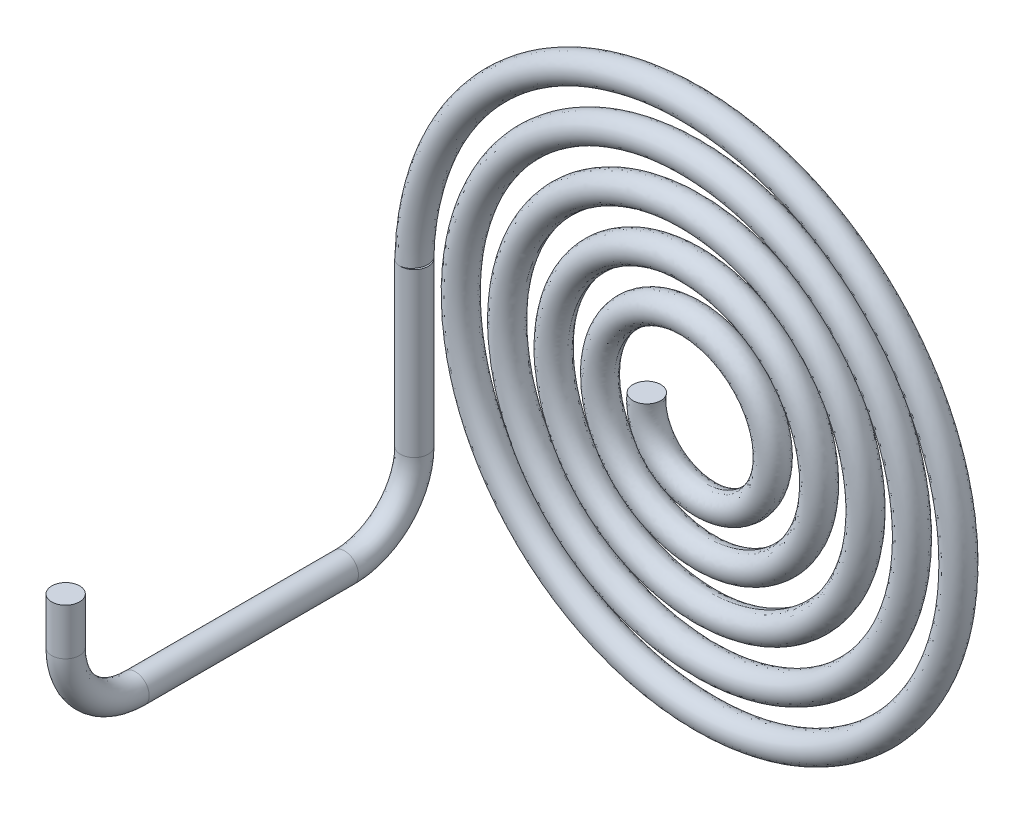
ISO-10303-21;
HEADER;
FILE_DESCRIPTION(('STEP AP214'),'2;1');
FILE_NAME('part.step','',(''),(''),'','','');
FILE_SCHEMA(('AUTOMOTIVE_DESIGN { 1 0 10303 214 1 1 1 1 }'));
ENDSEC;
DATA;
#1=APPLICATION_CONTEXT('core data for automotive mechanical design processes');
#2=APPLICATION_PROTOCOL_DEFINITION('international standard','automotive_design',2000,#1);
#3=PRODUCT_CONTEXT('',#1,'mechanical');
#4=PRODUCT('Part','Part','',(#3));
#5=PRODUCT_RELATED_PRODUCT_CATEGORY('part','',(#4));
#6=PRODUCT_DEFINITION_FORMATION('','',#4);
#7=PRODUCT_DEFINITION_CONTEXT('part definition',#1,'design');
#8=PRODUCT_DEFINITION('design','',#6,#7);
#9=PRODUCT_DEFINITION_SHAPE('','',#8);
#10=(LENGTH_UNIT() NAMED_UNIT(*) SI_UNIT(.MILLI.,.METRE.));
#11=(NAMED_UNIT(*) PLANE_ANGLE_UNIT() SI_UNIT($,.RADIAN.));
#12=(NAMED_UNIT(*) SI_UNIT($,.STERADIAN.) SOLID_ANGLE_UNIT());
#13=UNCERTAINTY_MEASURE_WITH_UNIT(LENGTH_MEASURE(1.E-05),#10,'distance_accuracy_value','');
#14=(GEOMETRIC_REPRESENTATION_CONTEXT(3) GLOBAL_UNCERTAINTY_ASSIGNED_CONTEXT((#13)) GLOBAL_UNIT_ASSIGNED_CONTEXT((#10,
#11,#12)) REPRESENTATION_CONTEXT('',''));
#15=CARTESIAN_POINT('',(0.,0.,0.));
#16=DIRECTION('',(0.,0.,1.));
#17=DIRECTION('',(1.,0.,0.));
#18=AXIS2_PLACEMENT_3D('',#15,#16,#17);
#19=CARTESIAN_POINT('',(-1.1,0.,-0.3));
#20=DIRECTION('',(0.,-1.,0.));
#21=DIRECTION('',(0.,0.,-1.));
#22=AXIS2_PLACEMENT_3D('',#19,#20,#21);
#23=PLANE('',#22);
#24=CARTESIAN_POINT('',(-1.1,0.,0.));
#25=DIRECTION('',(0.,1.,0.));
#26=DIRECTION('',(0.,0.,1.));
#27=AXIS2_PLACEMENT_3D('',#24,#25,#26);
#28=CIRCLE('',#27,0.3);
#29=CARTESIAN_POINT('',(-1.1,0.,0.3));
#30=VERTEX_POINT('',#29);
#31=EDGE_CURVE('E75',#30,#30,#28,.T.);
#32=ORIENTED_EDGE('',*,*,#31,.T.);
#33=EDGE_LOOP('',(#32));
#34=FACE_BOUND('',#33,.T.);
#35=ADVANCED_FACE('F43',(#34),#23,.F.);
#36=CARTESIAN_POINT('',(-6.1,0.,-0.3));
#37=DIRECTION('',(0.117333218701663,-0.993092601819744,0.));
#38=DIRECTION('',(0.993092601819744,0.117333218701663,0.));
#39=AXIS2_PLACEMENT_3D('',#36,#37,#38);
#40=PLANE('',#39);
#41=DIRECTION('',(0.,0.,1.));
#42=VECTOR('',#41,1.);
#43=CARTESIAN_POINT('',(-6.10000000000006,0.,-0.3));
#44=LINE('',#43,#42);
#45=CARTESIAN_POINT('',(-6.10000000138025,0.,-0.3));
#46=VERTEX_POINT('',#45);
#47=CARTESIAN_POINT('',(-6.10000000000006,0.,0.3));
#48=VERTEX_POINT('',#47);
#49=EDGE_CURVE('E72',#46,#48,#44,.T.);
#50=ORIENTED_EDGE('',*,*,#49,.F.);
#51=CARTESIAN_POINT('',(-6.1,0.,0.));
#52=DIRECTION('',(0.117333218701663,-0.993092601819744,0.));
#53=DIRECTION('',(0.,0.,1.));
#54=AXIS2_PLACEMENT_3D('',#51,#52,#53);
#55=CIRCLE('',#54,0.3);
#56=EDGE_CURVE('E52',#46,#48,#55,.T.);
#57=ORIENTED_EDGE('',*,*,#56,.T.);
#58=EDGE_LOOP('',(#50,#57));
#59=FACE_BOUND('',#58,.T.);
#60=ADVANCED_FACE('F45',(#59),#40,.T.);
#61=CARTESIAN_POINT('',(-1.1,0.,0.3));
#62=CARTESIAN_POINT('',(-1.12604221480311,-0.179987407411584,0.3));
#63=CARTESIAN_POINT('',(-1.10691809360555,-0.373080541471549,0.3));
#64=CARTESIAN_POINT('',(-0.971108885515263,-0.737648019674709,0.3));
#65=CARTESIAN_POINT('',(-0.85437839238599,-0.908681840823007,0.3));
#66=CARTESIAN_POINT('',(-0.541491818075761,-1.18038556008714,0.3));
#67=CARTESIAN_POINT('',(-0.345524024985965,-1.28063284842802,0.3));
#68=CARTESIAN_POINT('',(0.0839407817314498,-1.37526639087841,0.3));
#69=CARTESIAN_POINT('',(0.317048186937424,-1.3693662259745,0.3));
#70=CARTESIAN_POINT('',(0.764032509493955,-1.24059345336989,0.3));
#71=CARTESIAN_POINT('',(0.977408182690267,-1.11766120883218,0.3));
#72=CARTESIAN_POINT('',(1.32712923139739,-0.773623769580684,0.3));
#73=CARTESIAN_POINT('',(1.46298887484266,-0.552721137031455,0.3));
#74=CARTESIAN_POINT('',(1.61422494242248,-0.0593747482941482,0.3));
#75=CARTESIAN_POINT('',(1.6292636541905,0.212637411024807,0.3));
#76=CARTESIAN_POINT('',(1.52265857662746,0.743487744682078,0.3));
#77=CARTESIAN_POINT('',(1.40092746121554,1.00176266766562,0.3));
#78=CARTESIAN_POINT('',(1.03859093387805,1.43775572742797,0.3));
#79=CARTESIAN_POINT('',(0.798191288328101,1.61491863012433,0.3));
#80=CARTESIAN_POINT('',(0.248647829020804,1.83604745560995,0.3));
#81=CARTESIAN_POINT('',(-0.0600293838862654,1.87961356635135,0.3));
#82=CARTESIAN_POINT('',(-0.673997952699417,1.8105910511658,0.3));
#83=CARTESIAN_POINT('',(-0.97866533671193,1.69787451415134,0.3));
#84=CARTESIAN_POINT('',(-1.50736334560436,1.33136019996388,0.3));
#85=CARTESIAN_POINT('',(-1.73076445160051,1.07775924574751,0.3));
#86=CARTESIAN_POINT('',(-2.03404464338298,0.481675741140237,0.3));
#87=CARTESIAN_POINT('',(-2.11345193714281,0.139686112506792,0.3));
#88=CARTESIAN_POINT('',(-2.09742343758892,-0.554421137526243,0.3));
#89=CARTESIAN_POINT('',(-2.00180629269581,-0.905857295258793,0.3));
#90=CARTESIAN_POINT('',(-1.6462666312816,-1.53170710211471,0.3));
#91=CARTESIAN_POINT('',(-1.38651898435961,-1.80541391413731,0.3));
#92=CARTESIAN_POINT('',(-0.755389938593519,-2.20181583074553,0.3));
#93=CARTESIAN_POINT('',(-0.384517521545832,-2.32395844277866,0.3));
#94=CARTESIAN_POINT('',(0.38451752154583,-2.37604155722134,0.3));
#95=CARTESIAN_POINT('',(0.781946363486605,-2.30573471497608,0.3));
#96=CARTESIAN_POINT('',(1.50727403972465,-1.97709542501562,0.3));
#97=CARTESIAN_POINT('',(1.834387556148,-1.71890225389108,0.3));
#98=CARTESIAN_POINT('',(2.33335387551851,-1.06589353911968,0.3));
#99=CARTESIAN_POINT('',(2.50456613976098,-0.671591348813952,0.3));
#100=CARTESIAN_POINT('',(2.63929491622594,0.164965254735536,0.3));
#101=CARTESIAN_POINT('',(2.60248610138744,0.60644064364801,0.3));
#102=CARTESIAN_POINT('',(2.31717240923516,1.43134863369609,0.3));
#103=CARTESIAN_POINT('',(2.06875719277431,1.81391823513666,0.3));
#104=CARTESIAN_POINT('',(1.40851099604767,2.42314531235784,0.3));
#105=CARTESIAN_POINT('',(0.997184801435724,2.64906842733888,0.3));
#106=CARTESIAN_POINT('',(0.102636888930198,2.88010859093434,0.3));
#107=CARTESIAN_POINT('',(-0.379769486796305,2.88481115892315,0.3));
#108=CARTESIAN_POINT('',(-1.30206736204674,2.65946191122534,0.3));
#109=CARTESIAN_POINT('',(-1.74102099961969,2.42943599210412,0.3));
#110=CARTESIAN_POINT('',(-2.46626434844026,1.77784935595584,0.3));
#111=CARTESIAN_POINT('',(-2.75172184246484,1.35677086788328,0.3));
#112=CARTESIAN_POINT('',(-3.09159508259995,0.415779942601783,0.3));
#113=CARTESIAN_POINT('',(-3.14549708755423,-0.103291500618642,0.3));
#114=CARTESIAN_POINT('',(-2.99667073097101,-1.11846164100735,0.3));
#115=CARTESIAN_POINT('',(-2.79389049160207,-1.61355248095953,0.3));
#116=CARTESIAN_POINT('',(-2.16787035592,-2.45845941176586,0.3));
#117=CARTESIAN_POINT('',(-1.74507531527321,-2.80734328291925,0.3));
#118=CARTESIAN_POINT('',(-0.771068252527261,-3.26716464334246,0.3));
#119=CARTESIAN_POINT('',(-0.220710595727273,-3.37748032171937,0.3));
#120=CARTESIAN_POINT('',(0.880488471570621,-3.32135686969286,0.3));
#121=CARTESIAN_POINT('',(1.43025893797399,-3.1547744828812,0.3));
#122=CARTESIAN_POINT('',(2.39623104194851,-2.57197247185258,0.3));
#123=CARTESIAN_POINT('',(2.81140031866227,-2.15614492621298,0.3));
#124=CARTESIAN_POINT('',(3.40063258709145,-1.16425583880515,0.3));
#125=CARTESIAN_POINT('',(3.57395840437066,-0.58904829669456,0.3));
#126=CARTESIAN_POINT('',(3.62604159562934,0.589048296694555,0.3));
#127=CARTESIAN_POINT('',(3.5045514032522,1.19081222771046,0.3));
#128=CARTESIAN_POINT('',(2.9830818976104,2.27690001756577,0.3));
#129=CARTESIAN_POINT('',(2.58342615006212,2.76009333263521,0.3));
#130=CARTESIAN_POINT('',(1.59029522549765,3.48632212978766,0.3));
#131=CARTESIAN_POINT('',(0.997658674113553,3.72849949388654,0.3));
#132=CARTESIAN_POINT('',(-0.245989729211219,3.90332337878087,0.3));
#133=CARTESIAN_POINT('',(-0.895833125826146,3.8356060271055,0.3));
#134=CARTESIAN_POINT('',(-2.09866473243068,3.39375131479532,0.3));
#135=CARTESIAN_POINT('',(-2.65042832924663,3.01985320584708,0.3));
#136=CARTESIAN_POINT('',(-3.51916135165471,2.04339819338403,0.3));
#137=CARTESIAN_POINT('',(-3.83514802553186,1.44164847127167,0.3));
#138=CARTESIAN_POINT('',(-4.14599219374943,0.145899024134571,0.3));
#139=CARTESIAN_POINT('',(-4.14035870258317,-0.546901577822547,0.3));
#140=CARTESIAN_POINT('',(-3.79626520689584,-1.86064696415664,0.3));
#141=CARTESIAN_POINT('',(-3.45794454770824,-2.48027936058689,0.3));
#142=CARTESIAN_POINT('',(-2.51710775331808,-3.49477294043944,0.3));
#143=CARTESIAN_POINT('',(-1.91535045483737,-3.88852508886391,0.3));
#144=CARTESIAN_POINT('',(-0.58291204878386,-4.34714267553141,0.3));
#145=CARTESIAN_POINT('',(0.146553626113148,-4.41138063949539,0.3));
#146=CARTESIAN_POINT('',(1.56292532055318,-4.18275038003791,0.3));
#147=CARTESIAN_POINT('',(2.24843964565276,-3.88990649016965,0.3));
#148=CARTESIAN_POINT('',(3.40955545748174,-3.00438049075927,0.3));
#149=CARTESIAN_POINT('',(3.88392214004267,-2.41239139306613,0.3));
#150=CARTESIAN_POINT('',(4.50028461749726,-1.06046075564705,0.3));
#151=CARTESIAN_POINT('',(4.64150873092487,-0.301735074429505,0.3));
#152=CARTESIAN_POINT('',(4.54529027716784,1.20655580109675,0.3));
#153=CARTESIAN_POINT('',(4.30774269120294,1.9546605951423,0.3));
#154=CARTESIAN_POINT('',(3.49767829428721,3.26075496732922,0.3));
#155=CARTESIAN_POINT('',(2.92577087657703,3.81738674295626,0.3));
#156=CARTESIAN_POINT('',(1.57312173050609,4.59944932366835,0.3));
#157=CARTESIAN_POINT('',(0.793579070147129,4.82395838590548,0.3));
#158=CARTESIAN_POINT('',(-0.793579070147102,4.87604161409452,0.3));
#159=CARTESIAN_POINT('',(-1.59967810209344,4.70336810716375,0.3));
#160=CARTESIAN_POINT('',(-3.04652598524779,3.98906835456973,0.3));
#161=CARTESIAN_POINT('',(-3.68579912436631,3.44795005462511,0.3));
#162=CARTESIAN_POINT('',(-4.63929036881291,2.11469690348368,0.3));
#163=CARTESIAN_POINT('',(-4.95243286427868,1.32372599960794,0.3));
#164=CARTESIAN_POINT('',(-5.16735182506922,-0.327014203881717,0.3));
#165=CARTESIAN_POINT('',(-5.06872596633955,-1.1852256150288,0.3));
#166=CARTESIAN_POINT('',(-4.47033020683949,-2.76598082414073,0.3));
#167=CARTESIAN_POINT('',(-3.97094922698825,-3.48693843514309,0.3));
#168=CARTESIAN_POINT('',(-2.67828538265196,-4.61517737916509,0.3));
#169=CARTESIAN_POINT('',(-1.88611214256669,-5.02122763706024,0.3));
#170=CARTESIAN_POINT('',(-0.189161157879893,-5.41187578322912,0.3));
#171=CARTESIAN_POINT('',(0.714033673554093,-5.39590625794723,0.3));
#172=CARTESIAN_POINT('',(2.41922656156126,-4.9330684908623,0.3));
#173=CARTESIAN_POINT('',(3.21953773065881,-4.48645311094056,0.3));
#174=CARTESIAN_POINT('',(4.52328152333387,-3.25636614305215,0.3));
#175=CARTESIAN_POINT('',(5.02532834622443,-2.47393004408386,0.3));
#176=CARTESIAN_POINT('',(5.60269025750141,-0.750044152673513,0.3));
#177=CARTESIAN_POINT('',(5.67726420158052,0.189815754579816,0.3));
#178=CARTESIAN_POINT('',(5.36883001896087,2.00738899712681,0.3));
#179=CARTESIAN_POINT('',(4.9859224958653,2.88332681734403,0.3));
#180=CARTESIAN_POINT('',(3.84089061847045,4.3606514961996,0.3));
#181=CARTESIAN_POINT('',(3.07970747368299,4.96050100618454,0.3));
#182=CARTESIAN_POINT('',(1.34985325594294,5.7334045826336,0.3));
#183=CARTESIAN_POINT('',(0.382759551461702,5.90553714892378,0.3));
#184=CARTESIAN_POINT('',(-1.53262312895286,5.76922367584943,0.3));
#185=CARTESIAN_POINT('',(-2.47906225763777,5.46071090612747,0.3));
#186=CARTESIAN_POINT('',(-4.12527888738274,4.42338411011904,0.3));
#187=CARTESIAN_POINT('',(-4.82337317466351,3.69539683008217,0.3));
#188=CARTESIAN_POINT('',(-5.79826605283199,1.98198761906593,0.3));
#189=CARTESIAN_POINT('',(-6.07395833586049,0.998109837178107,0.3));
#190=CARTESIAN_POINT('',(-6.1,0.,0.3));
#191=CARTESIAN_POINT('',(-1.02152504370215,0.,0.3));
#192=CARTESIAN_POINT('',(-1.04757398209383,-0.166634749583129,0.3));
#193=CARTESIAN_POINT('',(-1.03166442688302,-0.347138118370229,0.3));
#194=CARTESIAN_POINT('',(-0.90864743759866,-0.688305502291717,0.3));
#195=CARTESIAN_POINT('',(-0.80074779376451,-0.849867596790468,0.3));
#196=CARTESIAN_POINT('',(-0.510245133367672,-1.10718040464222,0.3));
#197=CARTESIAN_POINT('',(-0.326539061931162,-1.20333931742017,0.3));
#198=CARTESIAN_POINT('',(0.076433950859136,-1.29603028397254,0.3));
#199=CARTESIAN_POINT('',(0.29683557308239,-1.29238809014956,0.3));
#200=CARTESIAN_POINT('',(0.719647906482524,-1.17453147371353,0.3));
#201=CARTESIAN_POINT('',(0.922945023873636,-1.05963110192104,0.3));
#202=CARTESIAN_POINT('',(1.25663778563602,-0.736682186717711,0.3));
#203=CARTESIAN_POINT('',(1.38746609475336,-0.527628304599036,0.3));
#204=CARTESIAN_POINT('',(1.53464965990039,-0.0604287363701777,0.3));
#205=CARTESIAN_POINT('',(1.5508991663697,0.198780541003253,0.3));
#206=CARTESIAN_POINT('',(1.45315604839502,0.704726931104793,0.3));
#207=CARTESIAN_POINT('',(1.33857025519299,0.952322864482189,0.3));
#208=CARTESIAN_POINT('',(0.995849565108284,1.37062982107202,0.3));
#209=CARTESIAN_POINT('',(0.766801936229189,1.54179428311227,0.3));
#210=CARTESIAN_POINT('',(0.242901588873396,1.75667844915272,0.3));
#211=CARTESIAN_POINT('',(-0.0529451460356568,1.80035416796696,0.3));
#212=CARTESIAN_POINT('',(-0.641395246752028,1.73800111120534,0.3));
#213=CARTESIAN_POINT('',(-0.934826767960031,1.63146501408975,0.3));
#214=CARTESIAN_POINT('',(-1.44423449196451,1.28291655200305,0.3));
#215=CARTESIAN_POINT('',(-1.66067796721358,1.04007965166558,0.3));
#216=CARTESIAN_POINT('',(-1.95549616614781,0.468947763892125,0.3));
#217=CARTESIAN_POINT('',(-2.03387989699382,0.139728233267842,0.3));
#218=CARTESIAN_POINT('',(-2.02222325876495,-0.528408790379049,0.3));
#219=CARTESIAN_POINT('',(-1.93175341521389,-0.868119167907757,0.3));
#220=CARTESIAN_POINT('',(-1.59236065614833,-1.47317748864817,0.3));
#221=CARTESIAN_POINT('',(-1.3426965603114,-1.73899824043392,0.3));
#222=CARTESIAN_POINT('',(-0.735626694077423,-2.1247388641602,0.3));
#223=CARTESIAN_POINT('',(-0.3773656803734,-2.24471082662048,0.3));
#224=CARTESIAN_POINT('',(0.365438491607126,-2.29879311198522,0.3));
#225=CARTESIAN_POINT('',(0.75073451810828,-2.23254283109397,0.3));
#226=CARTESIAN_POINT('',(1.45390828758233,-1.91807571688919,0.3));
#227=CARTESIAN_POINT('',(1.77225575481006,-1.66919533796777,0.3));
#228=CARTESIAN_POINT('',(2.25841493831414,-1.03914858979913,0.3));
#229=CARTESIAN_POINT('',(2.42631137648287,-0.657195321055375,0.3));
#230=CARTESIAN_POINT('',(2.56061983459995,0.153078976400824,0.3));
#231=CARTESIAN_POINT('',(2.52673034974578,0.58210872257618,0.3));
#232=CARTESIAN_POINT('',(2.25347473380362,1.38366655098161,0.3));
#233=CARTESIAN_POINT('',(2.01351595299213,1.75665296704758,0.3));
#234=CARTESIAN_POINT('',(1.3749320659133,2.35101099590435,0.3));
#235=CARTESIAN_POINT('',(0.97558632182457,2.5724894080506,0.3));
#236=CARTESIAN_POINT('',(0.107151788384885,2.8006702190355,0.3));
#237=CARTESIAN_POINT('',(-0.362598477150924,2.80711986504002,0.3));
#238=CARTESIAN_POINT('',(-1.2605376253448,2.59159394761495,0.3));
#239=CARTESIAN_POINT('',(-1.68916588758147,2.36908888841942,0.3));
#240=CARTESIAN_POINT('',(-2.39758912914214,1.73766927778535,0.3));
#241=CARTESIAN_POINT('',(-2.67750268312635,1.32809699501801,0.3));
#242=CARTESIAN_POINT('',(-3.01208447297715,0.41282419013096,0.3));
#243=CARTESIAN_POINT('',(-3.06653802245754,-0.0934887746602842,0.3));
#244=CARTESIAN_POINT('',(-2.92520008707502,-1.08349632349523,0.3));
#245=CARTESIAN_POINT('',(-2.72893361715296,-1.56760481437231,0.3));
#246=CARTESIAN_POINT('',(-2.12139991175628,-2.39387550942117,0.3));
#247=CARTESIAN_POINT('',(-1.70953319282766,-2.73615830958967,0.3));
#248=CARTESIAN_POINT('',(-0.760620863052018,-3.18828882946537,0.3));
#249=CARTESIAN_POINT('',(-0.223012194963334,-3.2979491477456,0.3));
#250=CARTESIAN_POINT('',(0.852438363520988,-3.24690087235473,0.3));
#251=CARTESIAN_POINT('',(1.39066343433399,-3.08576241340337,0.3));
#252=CARTESIAN_POINT('',(2.33633968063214,-2.51959410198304,0.3));
#253=CARTESIAN_POINT('',(2.74390452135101,-2.11401709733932,0.3));
#254=CARTESIAN_POINT('',(3.32310427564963,-1.14637297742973,0.3));
#255=CARTESIAN_POINT('',(3.49456843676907,-0.583791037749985,0.3));
#256=CARTESIAN_POINT('',(3.54925806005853,0.568198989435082,0.3));
#257=CARTESIAN_POINT('',(3.43208882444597,1.15795569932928,0.3));
#258=CARTESIAN_POINT('',(2.92524372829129,2.2222637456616,0.3));
#259=CARTESIAN_POINT('',(2.5350659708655,2.69691388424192,0.3));
#260=CARTESIAN_POINT('',(1.56510874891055,3.41085034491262,0.3));
#261=CARTESIAN_POINT('',(0.984860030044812,3.64997230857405,0.3));
#262=CARTESIAN_POINT('',(-0.232558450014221,3.82490192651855,0.3));
#263=CARTESIAN_POINT('',(-0.870039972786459,3.76033974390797,0.3));
#264=CARTESIAN_POINT('',(-2.04980061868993,3.33096120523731,0.3));
#265=CARTESIAN_POINT('',(-2.59215695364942,2.96568010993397,0.3));
#266=CARTESIAN_POINT('',(-3.44644278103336,2.01111373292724,0.3));
#267=CARTESIAN_POINT('',(-3.75820466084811,1.42140063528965,0.3));
#268=CARTESIAN_POINT('',(-4.06664588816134,0.151765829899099,0.3));
#269=CARTESIAN_POINT('',(-4.06296981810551,-0.528430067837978,0.3));
#270=CARTESIAN_POINT('',(-3.72908465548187,-1.81802057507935,0.3));
#271=CARTESIAN_POINT('',(-3.3984390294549,-2.42746543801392,0.3));
#272=CARTESIAN_POINT('',(-2.47800226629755,-3.42548385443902,0.3));
#273=CARTESIAN_POINT('',(-1.88781923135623,-3.81387771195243,0.3));
#274=CARTESIAN_POINT('',(-0.581140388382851,-4.26759985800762,0.3));
#275=CARTESIAN_POINT('',(0.135592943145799,-4.33257679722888,0.3));
#276=CARTESIAN_POINT('',(1.52694543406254,-4.11178821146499,0.3));
#277=CARTESIAN_POINT('',(2.20158400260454,-3.82560474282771,0.3));
#278=CARTESIAN_POINT('',(3.34434414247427,-2.95879924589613,0.3));
#279=CARTESIAN_POINT('',(3.81226612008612,-2.37781444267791,0.3));
#280=CARTESIAN_POINT('',(4.4212808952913,-1.05105001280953,0.3));
#281=CARTESIAN_POINT('',(4.56201637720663,-0.305067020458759,0.3));
#282=CARTESIAN_POINT('',(4.47119608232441,1.17756983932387,0.3));
#283=CARTESIAN_POINT('',(4.23923087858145,1.91420995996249,0.3));
#284=CARTESIAN_POINT('',(3.44603128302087,3.20023465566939,0.3));
#285=CARTESIAN_POINT('',(2.88445531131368,3.7493931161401,0.3));
#286=CARTESIAN_POINT('',(1.55614484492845,4.52171970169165,0.3));
#287=CARTESIAN_POINT('',(0.789237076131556,4.7445150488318,0.3));
#288=CARTESIAN_POINT('',(-0.771869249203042,4.79949894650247,0.3));
#289=CARTESIAN_POINT('',(-1.56602022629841,4.63127627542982,0.3));
#290=CARTESIAN_POINT('',(-2.99126828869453,3.93182613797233,0.3));
#291=CARTESIAN_POINT('',(-3.62210746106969,3.40026939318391,0.3));
#292=CARTESIAN_POINT('',(-4.56356154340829,2.09029981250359,0.3));
#293=CARTESIAN_POINT('',(-4.87377947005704,1.31173824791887,0.3));
#294=CARTESIAN_POINT('',(-5.08907117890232,-0.312794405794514,0.3));
#295=CARTESIAN_POINT('',(-4.99372162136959,-1.15868507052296,0.3));
#296=CARTESIAN_POINT('',(-4.40801922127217,-2.71650969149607,0.3));
#297=CARTESIAN_POINT('',(-3.91733973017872,-3.42815013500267,0.3));
#298=CARTESIAN_POINT('',(-2.64668573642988,-4.54216022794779,0.3));
#299=CARTESIAN_POINT('',(-1.86658013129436,-4.94410090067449,0.3));
#300=CARTESIAN_POINT('',(-0.195747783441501,-5.33258739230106,0.3));
#301=CARTESIAN_POINT('',(0.694868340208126,-5.31868764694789,0.3));
#302=CARTESIAN_POINT('',(2.37601278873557,-4.86626584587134,0.3));
#303=CARTESIAN_POINT('',(3.16620977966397,-4.42740952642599,0.3));
#304=CARTESIAN_POINT('',(4.45366383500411,-3.21785131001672,0.3));
#305=CARTESIAN_POINT('',(4.95045328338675,-2.44702777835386,0.3));
#306=CARTESIAN_POINT('',(5.52313676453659,-0.748926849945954,0.3));
#307=CARTESIAN_POINT('',(5.59855334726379,0.178214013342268,0.3));
#308=CARTESIAN_POINT('',(5.29815782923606,1.97084532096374,0.3));
#309=CARTESIAN_POINT('',(4.92199324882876,2.83596604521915,0.3));
#310=CARTESIAN_POINT('',(3.79581500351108,4.29509098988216,0.3));
#311=CARTESIAN_POINT('',(3.0456799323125,4.88858361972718,0.3));
#312=CARTESIAN_POINT('',(1.34103458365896,5.65433363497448,0.3));
#313=CARTESIAN_POINT('',(0.386680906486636,5.82607269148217,0.3));
#314=CARTESIAN_POINT('',(-1.50309993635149,5.69534297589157,0.3));
#315=CARTESIAN_POINT('',(-2.4381201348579,5.3924927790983,0.3));
#316=CARTESIAN_POINT('',(-4.06439657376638,4.3721658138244,0.3));
#317=CARTESIAN_POINT('',(-4.75509337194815,3.65455772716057,0.3));
#318=CARTESIAN_POINT('',(-5.72042288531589,1.96554362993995,0.3));
#319=CARTESIAN_POINT('',(-5.9944887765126,0.994313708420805,0.3));
#320=CARTESIAN_POINT('',(-6.02206710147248,0.00920771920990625,0.3));
#321=CARTESIAN_POINT('',(-0.8,0.,0.254858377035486));
#322=CARTESIAN_POINT('',(-0.826079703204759,-0.128953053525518,0.254858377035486));
#323=CARTESIAN_POINT('',(-0.819232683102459,-0.273905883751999,0.254858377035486));
#324=CARTESIAN_POINT('',(-0.73232653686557,-0.549017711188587,0.254858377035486));
#325=CARTESIAN_POINT('',(-0.649355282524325,-0.683842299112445,0.254858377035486));
#326=CARTESIAN_POINT('',(-0.422039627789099,-0.90053135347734,0.254858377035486));
#327=CARTESIAN_POINT('',(-0.272946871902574,-0.985149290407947,0.254858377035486));
#328=CARTESIAN_POINT('',(0.0552431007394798,-1.07235660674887,0.254858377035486));
#329=CARTESIAN_POINT('',(0.239777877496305,-1.07508838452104,0.254858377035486));
#330=CARTESIAN_POINT('',(0.594355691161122,-0.988046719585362,0.254858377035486));
#331=CARTESIAN_POINT('',(0.769202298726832,-0.895819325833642,0.254858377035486));
#332=CARTESIAN_POINT('',(1.05764919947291,-0.632400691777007,0.254858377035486));
#333=CARTESIAN_POINT('',(1.17427467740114,-0.456794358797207,0.254858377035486));
#334=CARTESIAN_POINT('',(1.3100185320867,-0.0634040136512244,0.254858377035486));
#335=CARTESIAN_POINT('',(1.32968596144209,0.159664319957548,0.254858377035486));
#336=CARTESIAN_POINT('',(1.25695905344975,0.595309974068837,0.254858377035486));
#337=CARTESIAN_POINT('',(1.16254361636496,0.81276044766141,0.254858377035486));
#338=CARTESIAN_POINT('',(0.875195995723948,1.18114173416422,0.254858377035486));
#339=CARTESIAN_POINT('',(0.678193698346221,1.33537334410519,0.254858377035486));
#340=CARTESIAN_POINT('',(0.226680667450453,1.53262961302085,0.254858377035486));
#341=CARTESIAN_POINT('',(-0.0329472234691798,1.57661474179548,0.254858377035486));
#342=CARTESIAN_POINT('',(-0.549361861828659,1.53308873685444,0.254858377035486));
#343=CARTESIAN_POINT('',(-0.811075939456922,1.44399925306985,0.254858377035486));
#344=CARTESIAN_POINT('',(-1.26602958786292,1.14616615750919,0.254858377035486));
#345=CARTESIAN_POINT('',(-1.46283253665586,0.933714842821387,0.254858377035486));
#346=CARTESIAN_POINT('',(-1.73376358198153,0.433018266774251,0.254858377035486));
#347=CARTESIAN_POINT('',(-1.80925792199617,0.1398471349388,0.254858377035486));
#348=CARTESIAN_POINT('',(-1.80994250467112,-0.454979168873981,0.254858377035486));
#349=CARTESIAN_POINT('',(-1.73400285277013,-0.761589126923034,0.254858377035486));
#350=CARTESIAN_POINT('',(-1.44019079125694,-1.30795566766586,0.254858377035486));
#351=CARTESIAN_POINT('',(-1.21899130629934,-1.55151505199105,0.254858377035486));
#352=CARTESIAN_POINT('',(-0.679837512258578,-1.907160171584,0.254858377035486));
#353=CARTESIAN_POINT('',(-0.357176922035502,-2.02100466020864,0.254858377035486));
#354=CARTESIAN_POINT('',(0.311580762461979,-2.08073035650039,0.254858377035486));
#355=CARTESIAN_POINT('',(0.662627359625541,-2.02593124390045,0.254858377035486));
#356=CARTESIAN_POINT('',(1.30326340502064,-1.75147041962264,0.254858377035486));
#357=CARTESIAN_POINT('',(1.59686540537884,-1.52887889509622,0.254858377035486));
#358=CARTESIAN_POINT('',(2.04687163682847,-0.963650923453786,0.254858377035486));
#359=CARTESIAN_POINT('',(2.20540791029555,-0.616557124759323,0.254858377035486));
#360=CARTESIAN_POINT('',(2.33852986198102,0.119525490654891,0.254858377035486));
#361=CARTESIAN_POINT('',(2.31288128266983,0.513422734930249,0.254858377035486));
#362=CARTESIAN_POINT('',(2.07366411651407,1.24906596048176,0.254858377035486));
#363=CARTESIAN_POINT('',(1.85757680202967,1.59500023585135,0.254858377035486));
#364=CARTESIAN_POINT('',(1.28014292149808,2.14738479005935,0.254858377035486));
#365=CARTESIAN_POINT('',(0.91461649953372,2.3563163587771,0.254858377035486));
#366=CARTESIAN_POINT('',(0.11989678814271,2.57642557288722,0.254858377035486));
#367=CARTESIAN_POINT('',(-0.314126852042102,2.58780700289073,0.254858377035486));
#368=CARTESIAN_POINT('',(-1.14330434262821,2.40001112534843,0.254858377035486));
#369=CARTESIAN_POINT('',(-1.5427853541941,2.19873651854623,0.254858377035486));
#370=CARTESIAN_POINT('',(-2.2037275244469,1.62424591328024,0.254858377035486));
#371=CARTESIAN_POINT('',(-2.46799122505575,1.24715421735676,0.254858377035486));
#372=CARTESIAN_POINT('',(-2.78763590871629,0.404480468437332,0.254858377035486));
#373=CARTESIAN_POINT('',(-2.84364639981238,-0.0658168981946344,0.254858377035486));
#374=CARTESIAN_POINT('',(-2.72344734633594,-0.984793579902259,0.254858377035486));
#375=CARTESIAN_POINT('',(-2.5455684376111,-1.43790026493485,0.254858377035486));
#376=CARTESIAN_POINT('',(-1.99021962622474,-2.21156318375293,0.254858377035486));
#377=CARTESIAN_POINT('',(-1.60920220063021,-2.53521198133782,0.254858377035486));
#378=CARTESIAN_POINT('',(-0.731129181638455,-2.96563221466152,0.254858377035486));
#379=CARTESIAN_POINT('',(-0.229509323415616,-3.07344253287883,0.254858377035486));
#380=CARTESIAN_POINT('',(0.773256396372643,-3.03672085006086,0.254858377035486));
#381=CARTESIAN_POINT('',(1.27889025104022,-2.89094992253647,0.254858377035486));
#382=CARTESIAN_POINT('',(2.16727381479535,-2.37173647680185,0.254858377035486));
#383=CARTESIAN_POINT('',(2.55337227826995,-1.99509547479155,0.254858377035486));
#384=CARTESIAN_POINT('',(3.10425149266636,-1.09589188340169,0.254858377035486));
#385=CARTESIAN_POINT('',(3.27046042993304,-0.568950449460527,0.254858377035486));
#386=CARTESIAN_POINT('',(3.33250768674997,0.509343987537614,0.254858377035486));
#387=CARTESIAN_POINT('',(3.22753597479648,1.06520580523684,0.254858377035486));
#388=CARTESIAN_POINT('',(2.7619737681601,2.06803234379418,0.254858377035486));
#389=CARTESIAN_POINT('',(2.3985511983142,2.51856615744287,0.254858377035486));
#390=CARTESIAN_POINT('',(1.49401045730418,3.19780288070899,0.254858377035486));
#391=CARTESIAN_POINT('',(0.948731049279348,3.42829982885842,0.254858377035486));
#392=CARTESIAN_POINT('',(-0.19464361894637,3.60352791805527,0.254858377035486));
#393=CARTESIAN_POINT('',(-0.797229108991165,3.54787238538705,0.254858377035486));
#394=CARTESIAN_POINT('',(-1.91186330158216,3.15371253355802,0.254858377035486));
#395=CARTESIAN_POINT('',(-2.42766410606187,2.81275619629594,0.254858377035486));
#396=CARTESIAN_POINT('',(-3.24116729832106,1.91997871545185,0.254858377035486));
#397=CARTESIAN_POINT('',(-3.5410031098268,1.36424351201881,0.254858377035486));
#398=CARTESIAN_POINT('',(-3.84266113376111,0.168327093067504,0.254858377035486));
#399=CARTESIAN_POINT('',(-3.84451062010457,-0.476287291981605,0.254858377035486));
#400=CARTESIAN_POINT('',(-3.53944231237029,-1.69769157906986,0.254858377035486));
#401=CARTESIAN_POINT('',(-3.23046235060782,-2.27837830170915,0.254858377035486));
#402=CARTESIAN_POINT('',(-2.36761233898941,-3.22988938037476,0.254858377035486));
#403=CARTESIAN_POINT('',(-1.81010201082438,-3.60315744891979,0.254858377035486));
#404=CARTESIAN_POINT('',(-0.576139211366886,-4.04306037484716,0.254858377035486));
#405=CARTESIAN_POINT('',(0.10465229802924,-4.11012334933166,0.254858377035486));
#406=CARTESIAN_POINT('',(1.42537868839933,-3.91147083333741,0.254858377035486));
#407=CARTESIAN_POINT('',(2.06931634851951,-3.64408890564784,0.254858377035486));
#408=CARTESIAN_POINT('',(3.16026070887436,-2.83012905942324,0.254858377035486));
#409=CARTESIAN_POINT('',(3.60999008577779,-2.28020801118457,0.254858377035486));
#410=CARTESIAN_POINT('',(4.19826321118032,-1.02448465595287,0.254858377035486));
#411=CARTESIAN_POINT('',(4.33761934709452,-0.314472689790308,0.254858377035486));
#412=CARTESIAN_POINT('',(4.26203738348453,1.09574607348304,0.254858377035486));
#413=CARTESIAN_POINT('',(4.04583055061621,1.80002284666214,0.254858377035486));
#414=CARTESIAN_POINT('',(3.30023819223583,3.02939334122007,0.254858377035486));
#415=CARTESIAN_POINT('',(2.76782660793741,3.55745556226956,0.254858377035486));
#416=CARTESIAN_POINT('',(1.50822120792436,4.30229864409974,0.254858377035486));
#417=CARTESIAN_POINT('',(0.776980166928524,4.52025638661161,0.254858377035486));
#418=CARTESIAN_POINT('',(-0.710585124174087,4.58342851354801,0.254858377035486));
#419=CARTESIAN_POINT('',(-1.4710082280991,4.4277699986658,0.254858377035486));
#420=CARTESIAN_POINT('',(-2.8352826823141,3.7702384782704,0.254858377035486));
#421=CARTESIAN_POINT('',(-3.44231381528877,3.26567281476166,0.254858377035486));
#422=CARTESIAN_POINT('',(-4.34978848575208,2.0214298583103,0.254858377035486));
#423=CARTESIAN_POINT('',(-4.65175071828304,1.27789831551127,0.254858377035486));
#424=CARTESIAN_POINT('',(-4.86809464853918,-0.272653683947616,0.254858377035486));
#425=CARTESIAN_POINT('',(-4.78199368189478,-1.08376441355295,0.254858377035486));
#426=CARTESIAN_POINT('',(-4.2321230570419,-2.57685883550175,0.254858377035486));
#427=CARTESIAN_POINT('',(-3.76600678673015,-3.26219807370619,0.254858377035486));
#428=CARTESIAN_POINT('',(-2.55748386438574,-4.3360418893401,0.254858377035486));
#429=CARTESIAN_POINT('',(-1.81144369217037,-4.72638171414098,0.254858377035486));
#430=CARTESIAN_POINT('',(-0.214341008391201,-5.10876612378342,0.254858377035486));
#431=CARTESIAN_POINT('',(0.640766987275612,-5.1007091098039,0.254858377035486));
#432=CARTESIAN_POINT('',(2.25402568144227,-4.67769028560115,0.254858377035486));
#433=CARTESIAN_POINT('',(3.01567160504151,-4.2607368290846,0.254858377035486));
#434=CARTESIAN_POINT('',(4.2571417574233,-3.10912872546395,0.254858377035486));
#435=CARTESIAN_POINT('',(4.73909029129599,-2.37108602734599,0.254858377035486));
#436=CARTESIAN_POINT('',(5.29856714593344,-0.745772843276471,0.254858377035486));
#437=CARTESIAN_POINT('',(5.37636239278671,0.145463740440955,0.254858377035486));
#438=CARTESIAN_POINT('',(5.09865902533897,1.86768706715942,0.254858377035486));
#439=CARTESIAN_POINT('',(4.74152893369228,2.70227247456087,0.254858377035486));
#440=CARTESIAN_POINT('',(3.66857214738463,4.11002183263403,0.254858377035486));
#441=CARTESIAN_POINT('',(2.94962441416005,4.68556978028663,0.254858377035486));
#442=CARTESIAN_POINT('',(1.31614056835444,5.43112618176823,0.254858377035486));
#443=CARTESIAN_POINT('',(0.397750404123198,5.60175440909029,0.254858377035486));
#444=CARTESIAN_POINT('',(-1.41975963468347,5.48678694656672,0.254858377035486));
#445=CARTESIAN_POINT('',(-2.3225456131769,5.19992148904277,0.254858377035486));
#446=CARTESIAN_POINT('',(-3.89253337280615,4.22758293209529,0.254858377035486));
#447=CARTESIAN_POINT('',(-4.56234797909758,3.53927401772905,0.254858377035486));
#448=CARTESIAN_POINT('',(-5.50068130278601,1.91912429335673,0.254858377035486));
#449=CARTESIAN_POINT('',(-5.77015610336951,0.983595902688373,0.254858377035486));
#450=CARTESIAN_POINT('',(-5.80207221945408,0.0351999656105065,0.254858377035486));
#451=CARTESIAN_POINT('',(-0.8,0.,-0.254858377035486));
#452=CARTESIAN_POINT('',(-0.826079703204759,-0.128953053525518,-0.254858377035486));
#453=CARTESIAN_POINT('',(-0.819232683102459,-0.273905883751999,-0.254858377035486));
#454=CARTESIAN_POINT('',(-0.73232653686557,-0.549017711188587,-0.254858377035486));
#455=CARTESIAN_POINT('',(-0.649355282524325,-0.683842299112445,-0.254858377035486));
#456=CARTESIAN_POINT('',(-0.422039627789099,-0.90053135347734,-0.254858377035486));
#457=CARTESIAN_POINT('',(-0.272946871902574,-0.985149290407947,-0.254858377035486));
#458=CARTESIAN_POINT('',(0.0552431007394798,-1.07235660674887,-0.254858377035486));
#459=CARTESIAN_POINT('',(0.239777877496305,-1.07508838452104,-0.254858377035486));
#460=CARTESIAN_POINT('',(0.594355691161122,-0.988046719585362,-0.254858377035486));
#461=CARTESIAN_POINT('',(0.769202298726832,-0.895819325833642,-0.254858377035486));
#462=CARTESIAN_POINT('',(1.05764919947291,-0.632400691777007,-0.254858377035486));
#463=CARTESIAN_POINT('',(1.17427467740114,-0.456794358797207,-0.254858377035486));
#464=CARTESIAN_POINT('',(1.3100185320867,-0.0634040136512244,-0.254858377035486));
#465=CARTESIAN_POINT('',(1.32968596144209,0.159664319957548,-0.254858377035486));
#466=CARTESIAN_POINT('',(1.25695905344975,0.595309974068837,-0.254858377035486));
#467=CARTESIAN_POINT('',(1.16254361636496,0.81276044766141,-0.254858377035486));
#468=CARTESIAN_POINT('',(0.875195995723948,1.18114173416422,-0.254858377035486));
#469=CARTESIAN_POINT('',(0.678193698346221,1.33537334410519,-0.254858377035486));
#470=CARTESIAN_POINT('',(0.226680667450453,1.53262961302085,-0.254858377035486));
#471=CARTESIAN_POINT('',(-0.0329472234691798,1.57661474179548,-0.254858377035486));
#472=CARTESIAN_POINT('',(-0.549361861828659,1.53308873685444,-0.254858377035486));
#473=CARTESIAN_POINT('',(-0.811075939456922,1.44399925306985,-0.254858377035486));
#474=CARTESIAN_POINT('',(-1.26602958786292,1.14616615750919,-0.254858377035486));
#475=CARTESIAN_POINT('',(-1.46283253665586,0.933714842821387,-0.254858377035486));
#476=CARTESIAN_POINT('',(-1.73376358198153,0.433018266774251,-0.254858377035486));
#477=CARTESIAN_POINT('',(-1.80925792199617,0.1398471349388,-0.254858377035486));
#478=CARTESIAN_POINT('',(-1.80994250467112,-0.454979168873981,-0.254858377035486));
#479=CARTESIAN_POINT('',(-1.73400285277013,-0.761589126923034,-0.254858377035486));
#480=CARTESIAN_POINT('',(-1.44019079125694,-1.30795566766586,-0.254858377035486));
#481=CARTESIAN_POINT('',(-1.21899130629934,-1.55151505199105,-0.254858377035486));
#482=CARTESIAN_POINT('',(-0.679837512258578,-1.907160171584,-0.254858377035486));
#483=CARTESIAN_POINT('',(-0.357176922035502,-2.02100466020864,-0.254858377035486));
#484=CARTESIAN_POINT('',(0.311580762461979,-2.08073035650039,-0.254858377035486));
#485=CARTESIAN_POINT('',(0.662627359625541,-2.02593124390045,-0.254858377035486));
#486=CARTESIAN_POINT('',(1.30326340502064,-1.75147041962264,-0.254858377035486));
#487=CARTESIAN_POINT('',(1.59686540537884,-1.52887889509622,-0.254858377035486));
#488=CARTESIAN_POINT('',(2.04687163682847,-0.963650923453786,-0.254858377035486));
#489=CARTESIAN_POINT('',(2.20540791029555,-0.616557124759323,-0.254858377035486));
#490=CARTESIAN_POINT('',(2.33852986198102,0.119525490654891,-0.254858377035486));
#491=CARTESIAN_POINT('',(2.31288128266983,0.513422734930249,-0.254858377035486));
#492=CARTESIAN_POINT('',(2.07366411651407,1.24906596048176,-0.254858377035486));
#493=CARTESIAN_POINT('',(1.85757680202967,1.59500023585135,-0.254858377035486));
#494=CARTESIAN_POINT('',(1.28014292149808,2.14738479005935,-0.254858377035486));
#495=CARTESIAN_POINT('',(0.91461649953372,2.3563163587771,-0.254858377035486));
#496=CARTESIAN_POINT('',(0.11989678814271,2.57642557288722,-0.254858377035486));
#497=CARTESIAN_POINT('',(-0.314126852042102,2.58780700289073,-0.254858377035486));
#498=CARTESIAN_POINT('',(-1.14330434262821,2.40001112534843,-0.254858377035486));
#499=CARTESIAN_POINT('',(-1.5427853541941,2.19873651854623,-0.254858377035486));
#500=CARTESIAN_POINT('',(-2.2037275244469,1.62424591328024,-0.254858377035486));
#501=CARTESIAN_POINT('',(-2.46799122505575,1.24715421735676,-0.254858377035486));
#502=CARTESIAN_POINT('',(-2.78763590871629,0.404480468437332,-0.254858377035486));
#503=CARTESIAN_POINT('',(-2.84364639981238,-0.0658168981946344,-0.254858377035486));
#504=CARTESIAN_POINT('',(-2.72344734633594,-0.984793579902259,-0.254858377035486));
#505=CARTESIAN_POINT('',(-2.5455684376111,-1.43790026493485,-0.254858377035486));
#506=CARTESIAN_POINT('',(-1.99021962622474,-2.21156318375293,-0.254858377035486));
#507=CARTESIAN_POINT('',(-1.60920220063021,-2.53521198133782,-0.254858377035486));
#508=CARTESIAN_POINT('',(-0.731129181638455,-2.96563221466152,-0.254858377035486));
#509=CARTESIAN_POINT('',(-0.229509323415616,-3.07344253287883,-0.254858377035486));
#510=CARTESIAN_POINT('',(0.773256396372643,-3.03672085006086,-0.254858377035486));
#511=CARTESIAN_POINT('',(1.27889025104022,-2.89094992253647,-0.254858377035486));
#512=CARTESIAN_POINT('',(2.16727381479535,-2.37173647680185,-0.254858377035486));
#513=CARTESIAN_POINT('',(2.55337227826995,-1.99509547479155,-0.254858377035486));
#514=CARTESIAN_POINT('',(3.10425149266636,-1.09589188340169,-0.254858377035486));
#515=CARTESIAN_POINT('',(3.27046042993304,-0.568950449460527,-0.254858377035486));
#516=CARTESIAN_POINT('',(3.33250768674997,0.509343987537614,-0.254858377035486));
#517=CARTESIAN_POINT('',(3.22753597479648,1.06520580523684,-0.254858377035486));
#518=CARTESIAN_POINT('',(2.7619737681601,2.06803234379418,-0.254858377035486));
#519=CARTESIAN_POINT('',(2.3985511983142,2.51856615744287,-0.254858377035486));
#520=CARTESIAN_POINT('',(1.49401045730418,3.19780288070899,-0.254858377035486));
#521=CARTESIAN_POINT('',(0.948731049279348,3.42829982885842,-0.254858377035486));
#522=CARTESIAN_POINT('',(-0.19464361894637,3.60352791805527,-0.254858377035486));
#523=CARTESIAN_POINT('',(-0.797229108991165,3.54787238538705,-0.254858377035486));
#524=CARTESIAN_POINT('',(-1.91186330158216,3.15371253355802,-0.254858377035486));
#525=CARTESIAN_POINT('',(-2.42766410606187,2.81275619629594,-0.254858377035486));
#526=CARTESIAN_POINT('',(-3.24116729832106,1.91997871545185,-0.254858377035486));
#527=CARTESIAN_POINT('',(-3.5410031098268,1.36424351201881,-0.254858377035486));
#528=CARTESIAN_POINT('',(-3.84266113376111,0.168327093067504,-0.254858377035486));
#529=CARTESIAN_POINT('',(-3.84451062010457,-0.476287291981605,-0.254858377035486));
#530=CARTESIAN_POINT('',(-3.53944231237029,-1.69769157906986,-0.254858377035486));
#531=CARTESIAN_POINT('',(-3.23046235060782,-2.27837830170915,-0.254858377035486));
#532=CARTESIAN_POINT('',(-2.36761233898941,-3.22988938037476,-0.254858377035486));
#533=CARTESIAN_POINT('',(-1.81010201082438,-3.60315744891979,-0.254858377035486));
#534=CARTESIAN_POINT('',(-0.576139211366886,-4.04306037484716,-0.254858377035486));
#535=CARTESIAN_POINT('',(0.10465229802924,-4.11012334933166,-0.254858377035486));
#536=CARTESIAN_POINT('',(1.42537868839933,-3.91147083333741,-0.254858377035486));
#537=CARTESIAN_POINT('',(2.06931634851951,-3.64408890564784,-0.254858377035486));
#538=CARTESIAN_POINT('',(3.16026070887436,-2.83012905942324,-0.254858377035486));
#539=CARTESIAN_POINT('',(3.60999008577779,-2.28020801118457,-0.254858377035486));
#540=CARTESIAN_POINT('',(4.19826321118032,-1.02448465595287,-0.254858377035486));
#541=CARTESIAN_POINT('',(4.33761934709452,-0.314472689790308,-0.254858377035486));
#542=CARTESIAN_POINT('',(4.26203738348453,1.09574607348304,-0.254858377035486));
#543=CARTESIAN_POINT('',(4.04583055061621,1.80002284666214,-0.254858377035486));
#544=CARTESIAN_POINT('',(3.30023819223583,3.02939334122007,-0.254858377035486));
#545=CARTESIAN_POINT('',(2.76782660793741,3.55745556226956,-0.254858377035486));
#546=CARTESIAN_POINT('',(1.50822120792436,4.30229864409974,-0.254858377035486));
#547=CARTESIAN_POINT('',(0.776980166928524,4.52025638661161,-0.254858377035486));
#548=CARTESIAN_POINT('',(-0.710585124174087,4.58342851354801,-0.254858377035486));
#549=CARTESIAN_POINT('',(-1.4710082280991,4.4277699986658,-0.254858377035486));
#550=CARTESIAN_POINT('',(-2.8352826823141,3.7702384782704,-0.254858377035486));
#551=CARTESIAN_POINT('',(-3.44231381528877,3.26567281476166,-0.254858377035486));
#552=CARTESIAN_POINT('',(-4.34978848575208,2.0214298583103,-0.254858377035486));
#553=CARTESIAN_POINT('',(-4.65175071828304,1.27789831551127,-0.254858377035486));
#554=CARTESIAN_POINT('',(-4.86809464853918,-0.272653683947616,-0.254858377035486));
#555=CARTESIAN_POINT('',(-4.78199368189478,-1.08376441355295,-0.254858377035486));
#556=CARTESIAN_POINT('',(-4.2321230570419,-2.57685883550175,-0.254858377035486));
#557=CARTESIAN_POINT('',(-3.76600678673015,-3.26219807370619,-0.254858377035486));
#558=CARTESIAN_POINT('',(-2.55748386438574,-4.3360418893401,-0.254858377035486));
#559=CARTESIAN_POINT('',(-1.81144369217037,-4.72638171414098,-0.254858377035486));
#560=CARTESIAN_POINT('',(-0.214341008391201,-5.10876612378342,-0.254858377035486));
#561=CARTESIAN_POINT('',(0.640766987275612,-5.1007091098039,-0.254858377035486));
#562=CARTESIAN_POINT('',(2.25402568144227,-4.67769028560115,-0.254858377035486));
#563=CARTESIAN_POINT('',(3.01567160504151,-4.2607368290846,-0.254858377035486));
#564=CARTESIAN_POINT('',(4.2571417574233,-3.10912872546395,-0.254858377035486));
#565=CARTESIAN_POINT('',(4.73909029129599,-2.37108602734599,-0.254858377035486));
#566=CARTESIAN_POINT('',(5.29856714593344,-0.745772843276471,-0.254858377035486));
#567=CARTESIAN_POINT('',(5.37636239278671,0.145463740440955,-0.254858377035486));
#568=CARTESIAN_POINT('',(5.09865902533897,1.86768706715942,-0.254858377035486));
#569=CARTESIAN_POINT('',(4.74152893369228,2.70227247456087,-0.254858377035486));
#570=CARTESIAN_POINT('',(3.66857214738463,4.11002183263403,-0.254858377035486));
#571=CARTESIAN_POINT('',(2.94962441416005,4.68556978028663,-0.254858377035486));
#572=CARTESIAN_POINT('',(1.31614056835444,5.43112618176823,-0.254858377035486));
#573=CARTESIAN_POINT('',(0.397750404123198,5.60175440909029,-0.254858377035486));
#574=CARTESIAN_POINT('',(-1.41975963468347,5.48678694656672,-0.254858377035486));
#575=CARTESIAN_POINT('',(-2.3225456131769,5.19992148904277,-0.254858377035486));
#576=CARTESIAN_POINT('',(-3.89253337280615,4.22758293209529,-0.254858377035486));
#577=CARTESIAN_POINT('',(-4.56234797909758,3.53927401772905,-0.254858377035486));
#578=CARTESIAN_POINT('',(-5.50068130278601,1.91912429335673,-0.254858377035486));
#579=CARTESIAN_POINT('',(-5.77015610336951,0.983595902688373,-0.254858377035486));
#580=CARTESIAN_POINT('',(-5.80207221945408,0.0351999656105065,-0.254858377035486));
#581=CARTESIAN_POINT('',(-1.02152504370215,0.,-0.3));
#582=CARTESIAN_POINT('',(-1.04757398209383,-0.166634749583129,-0.3));
#583=CARTESIAN_POINT('',(-1.03166442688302,-0.347138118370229,-0.3));
#584=CARTESIAN_POINT('',(-0.90864743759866,-0.688305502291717,-0.3));
#585=CARTESIAN_POINT('',(-0.80074779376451,-0.849867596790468,-0.3));
#586=CARTESIAN_POINT('',(-0.510245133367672,-1.10718040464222,-0.3));
#587=CARTESIAN_POINT('',(-0.326539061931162,-1.20333931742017,-0.3));
#588=CARTESIAN_POINT('',(0.076433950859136,-1.29603028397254,-0.3));
#589=CARTESIAN_POINT('',(0.29683557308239,-1.29238809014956,-0.3));
#590=CARTESIAN_POINT('',(0.719647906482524,-1.17453147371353,-0.3));
#591=CARTESIAN_POINT('',(0.922945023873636,-1.05963110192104,-0.3));
#592=CARTESIAN_POINT('',(1.25663778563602,-0.736682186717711,-0.3));
#593=CARTESIAN_POINT('',(1.38746609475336,-0.527628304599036,-0.3));
#594=CARTESIAN_POINT('',(1.53464965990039,-0.0604287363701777,-0.3));
#595=CARTESIAN_POINT('',(1.5508991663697,0.198780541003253,-0.3));
#596=CARTESIAN_POINT('',(1.45315604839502,0.704726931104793,-0.3));
#597=CARTESIAN_POINT('',(1.33857025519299,0.952322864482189,-0.3));
#598=CARTESIAN_POINT('',(0.995849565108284,1.37062982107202,-0.3));
#599=CARTESIAN_POINT('',(0.766801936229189,1.54179428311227,-0.3));
#600=CARTESIAN_POINT('',(0.242901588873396,1.75667844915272,-0.3));
#601=CARTESIAN_POINT('',(-0.0529451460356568,1.80035416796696,-0.3));
#602=CARTESIAN_POINT('',(-0.641395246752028,1.73800111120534,-0.3));
#603=CARTESIAN_POINT('',(-0.934826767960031,1.63146501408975,-0.3));
#604=CARTESIAN_POINT('',(-1.44423449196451,1.28291655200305,-0.3));
#605=CARTESIAN_POINT('',(-1.66067796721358,1.04007965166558,-0.3));
#606=CARTESIAN_POINT('',(-1.95549616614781,0.468947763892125,-0.3));
#607=CARTESIAN_POINT('',(-2.03387989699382,0.139728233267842,-0.3));
#608=CARTESIAN_POINT('',(-2.02222325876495,-0.528408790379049,-0.3));
#609=CARTESIAN_POINT('',(-1.93175341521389,-0.868119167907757,-0.3));
#610=CARTESIAN_POINT('',(-1.59236065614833,-1.47317748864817,-0.3));
#611=CARTESIAN_POINT('',(-1.3426965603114,-1.73899824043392,-0.3));
#612=CARTESIAN_POINT('',(-0.735626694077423,-2.1247388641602,-0.3));
#613=CARTESIAN_POINT('',(-0.3773656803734,-2.24471082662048,-0.3));
#614=CARTESIAN_POINT('',(0.365438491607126,-2.29879311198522,-0.3));
#615=CARTESIAN_POINT('',(0.75073451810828,-2.23254283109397,-0.3));
#616=CARTESIAN_POINT('',(1.45390828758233,-1.91807571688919,-0.3));
#617=CARTESIAN_POINT('',(1.77225575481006,-1.66919533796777,-0.3));
#618=CARTESIAN_POINT('',(2.25841493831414,-1.03914858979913,-0.3));
#619=CARTESIAN_POINT('',(2.42631137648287,-0.657195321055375,-0.3));
#620=CARTESIAN_POINT('',(2.56061983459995,0.153078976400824,-0.3));
#621=CARTESIAN_POINT('',(2.52673034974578,0.58210872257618,-0.3));
#622=CARTESIAN_POINT('',(2.25347473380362,1.38366655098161,-0.3));
#623=CARTESIAN_POINT('',(2.01351595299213,1.75665296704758,-0.3));
#624=CARTESIAN_POINT('',(1.3749320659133,2.35101099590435,-0.3));
#625=CARTESIAN_POINT('',(0.97558632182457,2.5724894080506,-0.3));
#626=CARTESIAN_POINT('',(0.107151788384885,2.8006702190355,-0.3));
#627=CARTESIAN_POINT('',(-0.362598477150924,2.80711986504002,-0.3));
#628=CARTESIAN_POINT('',(-1.2605376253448,2.59159394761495,-0.3));
#629=CARTESIAN_POINT('',(-1.68916588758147,2.36908888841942,-0.3));
#630=CARTESIAN_POINT('',(-2.39758912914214,1.73766927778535,-0.3));
#631=CARTESIAN_POINT('',(-2.67750268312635,1.32809699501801,-0.3));
#632=CARTESIAN_POINT('',(-3.01208447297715,0.41282419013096,-0.3));
#633=CARTESIAN_POINT('',(-3.06653802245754,-0.0934887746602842,-0.3));
#634=CARTESIAN_POINT('',(-2.92520008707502,-1.08349632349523,-0.3));
#635=CARTESIAN_POINT('',(-2.72893361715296,-1.56760481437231,-0.3));
#636=CARTESIAN_POINT('',(-2.12139991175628,-2.39387550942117,-0.3));
#637=CARTESIAN_POINT('',(-1.70953319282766,-2.73615830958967,-0.3));
#638=CARTESIAN_POINT('',(-0.760620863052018,-3.18828882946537,-0.3));
#639=CARTESIAN_POINT('',(-0.223012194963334,-3.2979491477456,-0.3));
#640=CARTESIAN_POINT('',(0.852438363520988,-3.24690087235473,-0.3));
#641=CARTESIAN_POINT('',(1.39066343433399,-3.08576241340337,-0.3));
#642=CARTESIAN_POINT('',(2.33633968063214,-2.51959410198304,-0.3));
#643=CARTESIAN_POINT('',(2.74390452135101,-2.11401709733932,-0.3));
#644=CARTESIAN_POINT('',(3.32310427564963,-1.14637297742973,-0.3));
#645=CARTESIAN_POINT('',(3.49456843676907,-0.583791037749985,-0.3));
#646=CARTESIAN_POINT('',(3.54925806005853,0.568198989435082,-0.3));
#647=CARTESIAN_POINT('',(3.43208882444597,1.15795569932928,-0.3));
#648=CARTESIAN_POINT('',(2.92524372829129,2.2222637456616,-0.3));
#649=CARTESIAN_POINT('',(2.5350659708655,2.69691388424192,-0.3));
#650=CARTESIAN_POINT('',(1.56510874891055,3.41085034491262,-0.3));
#651=CARTESIAN_POINT('',(0.984860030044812,3.64997230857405,-0.3));
#652=CARTESIAN_POINT('',(-0.232558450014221,3.82490192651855,-0.3));
#653=CARTESIAN_POINT('',(-0.870039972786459,3.76033974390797,-0.3));
#654=CARTESIAN_POINT('',(-2.04980061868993,3.33096120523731,-0.3));
#655=CARTESIAN_POINT('',(-2.59215695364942,2.96568010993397,-0.3));
#656=CARTESIAN_POINT('',(-3.44644278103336,2.01111373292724,-0.3));
#657=CARTESIAN_POINT('',(-3.75820466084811,1.42140063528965,-0.3));
#658=CARTESIAN_POINT('',(-4.06664588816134,0.151765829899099,-0.3));
#659=CARTESIAN_POINT('',(-4.06296981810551,-0.528430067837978,-0.3));
#660=CARTESIAN_POINT('',(-3.72908465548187,-1.81802057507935,-0.3));
#661=CARTESIAN_POINT('',(-3.3984390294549,-2.42746543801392,-0.3));
#662=CARTESIAN_POINT('',(-2.47800226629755,-3.42548385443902,-0.3));
#663=CARTESIAN_POINT('',(-1.88781923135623,-3.81387771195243,-0.3));
#664=CARTESIAN_POINT('',(-0.581140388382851,-4.26759985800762,-0.3));
#665=CARTESIAN_POINT('',(0.135592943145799,-4.33257679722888,-0.3));
#666=CARTESIAN_POINT('',(1.52694543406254,-4.11178821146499,-0.3));
#667=CARTESIAN_POINT('',(2.20158400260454,-3.82560474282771,-0.3));
#668=CARTESIAN_POINT('',(3.34434414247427,-2.95879924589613,-0.3));
#669=CARTESIAN_POINT('',(3.81226612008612,-2.37781444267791,-0.3));
#670=CARTESIAN_POINT('',(4.4212808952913,-1.05105001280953,-0.3));
#671=CARTESIAN_POINT('',(4.56201637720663,-0.305067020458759,-0.3));
#672=CARTESIAN_POINT('',(4.47119608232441,1.17756983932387,-0.3));
#673=CARTESIAN_POINT('',(4.23923087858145,1.91420995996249,-0.3));
#674=CARTESIAN_POINT('',(3.44603128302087,3.20023465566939,-0.3));
#675=CARTESIAN_POINT('',(2.88445531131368,3.7493931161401,-0.3));
#676=CARTESIAN_POINT('',(1.55614484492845,4.52171970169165,-0.3));
#677=CARTESIAN_POINT('',(0.789237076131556,4.7445150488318,-0.3));
#678=CARTESIAN_POINT('',(-0.771869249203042,4.79949894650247,-0.3));
#679=CARTESIAN_POINT('',(-1.56602022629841,4.63127627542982,-0.3));
#680=CARTESIAN_POINT('',(-2.99126828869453,3.93182613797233,-0.3));
#681=CARTESIAN_POINT('',(-3.62210746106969,3.40026939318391,-0.3));
#682=CARTESIAN_POINT('',(-4.56356154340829,2.09029981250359,-0.3));
#683=CARTESIAN_POINT('',(-4.87377947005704,1.31173824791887,-0.3));
#684=CARTESIAN_POINT('',(-5.08907117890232,-0.312794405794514,-0.3));
#685=CARTESIAN_POINT('',(-4.99372162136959,-1.15868507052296,-0.3));
#686=CARTESIAN_POINT('',(-4.40801922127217,-2.71650969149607,-0.3));
#687=CARTESIAN_POINT('',(-3.91733973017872,-3.42815013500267,-0.3));
#688=CARTESIAN_POINT('',(-2.64668573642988,-4.54216022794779,-0.3));
#689=CARTESIAN_POINT('',(-1.86658013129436,-4.94410090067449,-0.3));
#690=CARTESIAN_POINT('',(-0.195747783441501,-5.33258739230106,-0.3));
#691=CARTESIAN_POINT('',(0.694868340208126,-5.31868764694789,-0.3));
#692=CARTESIAN_POINT('',(2.37601278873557,-4.86626584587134,-0.3));
#693=CARTESIAN_POINT('',(3.16620977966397,-4.42740952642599,-0.3));
#694=CARTESIAN_POINT('',(4.45366383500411,-3.21785131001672,-0.3));
#695=CARTESIAN_POINT('',(4.95045328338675,-2.44702777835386,-0.3));
#696=CARTESIAN_POINT('',(5.52313676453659,-0.748926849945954,-0.3));
#697=CARTESIAN_POINT('',(5.59855334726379,0.178214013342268,-0.3));
#698=CARTESIAN_POINT('',(5.29815782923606,1.97084532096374,-0.3));
#699=CARTESIAN_POINT('',(4.92199324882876,2.83596604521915,-0.3));
#700=CARTESIAN_POINT('',(3.79581500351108,4.29509098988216,-0.3));
#701=CARTESIAN_POINT('',(3.0456799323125,4.88858361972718,-0.3));
#702=CARTESIAN_POINT('',(1.34103458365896,5.65433363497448,-0.3));
#703=CARTESIAN_POINT('',(0.386680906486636,5.82607269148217,-0.3));
#704=CARTESIAN_POINT('',(-1.50309993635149,5.69534297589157,-0.3));
#705=CARTESIAN_POINT('',(-2.4381201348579,5.3924927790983,-0.3));
#706=CARTESIAN_POINT('',(-4.06439657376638,4.3721658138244,-0.3));
#707=CARTESIAN_POINT('',(-4.75509337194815,3.65455772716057,-0.3));
#708=CARTESIAN_POINT('',(-5.72042288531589,1.96554362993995,-0.3));
#709=CARTESIAN_POINT('',(-5.9944887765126,0.994313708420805,-0.3));
#710=CARTESIAN_POINT('',(-6.02206710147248,0.00920771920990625,-0.3));
#711=CARTESIAN_POINT('',(-1.17847495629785,0.,-0.3));
#712=CARTESIAN_POINT('',(-1.20451044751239,-0.193340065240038,-0.3));
#713=CARTESIAN_POINT('',(-1.18217176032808,-0.399022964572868,-0.3));
#714=CARTESIAN_POINT('',(-1.03357033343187,-0.786990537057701,-0.3));
#715=CARTESIAN_POINT('',(-0.908008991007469,-0.967496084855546,-0.3));
#716=CARTESIAN_POINT('',(-0.57273850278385,-1.25359071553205,-0.3));
#717=CARTESIAN_POINT('',(-0.364508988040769,-1.35792637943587,-0.3));
#718=CARTESIAN_POINT('',(0.0914476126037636,-1.45450249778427,-0.3));
#719=CARTESIAN_POINT('',(0.337260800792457,-1.44634436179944,-0.3));
#720=CARTESIAN_POINT('',(0.808417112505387,-1.30665543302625,-0.3));
#721=CARTESIAN_POINT('',(1.0318713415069,-1.17569131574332,-0.3));
#722=CARTESIAN_POINT('',(1.39762067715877,-0.810565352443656,-0.3));
#723=CARTESIAN_POINT('',(1.53851165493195,-0.577813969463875,-0.3));
#724=CARTESIAN_POINT('',(1.69380022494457,-0.0583207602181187,-0.3));
#725=CARTESIAN_POINT('',(1.7076281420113,0.226494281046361,-0.3));
#726=CARTESIAN_POINT('',(1.5921611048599,0.782248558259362,-0.3));
#727=CARTESIAN_POINT('',(1.4632846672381,1.05120247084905,-0.3));
#728=CARTESIAN_POINT('',(1.08133230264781,1.50488163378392,-0.3));
#729=CARTESIAN_POINT('',(0.829580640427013,1.68804297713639,-0.3));
#730=CARTESIAN_POINT('',(0.254394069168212,1.91541646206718,-0.3));
#731=CARTESIAN_POINT('',(-0.067113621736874,1.95887296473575,-0.3));
#732=CARTESIAN_POINT('',(-0.706600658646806,1.88318099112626,-0.3));
#733=CARTESIAN_POINT('',(-1.02250390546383,1.76428401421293,-0.3));
#734=CARTESIAN_POINT('',(-1.5704921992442,1.37980384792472,-0.3));
#735=CARTESIAN_POINT('',(-1.80085093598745,1.11543883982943,-0.3));
#736=CARTESIAN_POINT('',(-2.11259312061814,0.49440371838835,-0.3));
#737=CARTESIAN_POINT('',(-2.1930239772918,0.139643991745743,-0.3));
#738=CARTESIAN_POINT('',(-2.17262361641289,-0.580433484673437,-0.3));
#739=CARTESIAN_POINT('',(-2.07185917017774,-0.943595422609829,-0.3));
#740=CARTESIAN_POINT('',(-1.70017260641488,-1.59023671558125,-0.3));
#741=CARTESIAN_POINT('',(-1.43034140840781,-1.87182958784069,-0.3));
#742=CARTESIAN_POINT('',(-0.775153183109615,-2.27889279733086,-0.3));
#743=CARTESIAN_POINT('',(-0.391669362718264,-2.40320605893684,-0.3));
#744=CARTESIAN_POINT('',(0.403596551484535,-2.45329000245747,-0.3));
#745=CARTESIAN_POINT('',(0.81315820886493,-2.3789265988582,-0.3));
#746=CARTESIAN_POINT('',(1.56063979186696,-2.03611513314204,-0.3));
#747=CARTESIAN_POINT('',(1.89651935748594,-1.76860916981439,-0.3));
#748=CARTESIAN_POINT('',(2.40829281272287,-1.09263848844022,-0.3));
#749=CARTESIAN_POINT('',(2.58282090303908,-0.68598737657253,-0.3));
#750=CARTESIAN_POINT('',(2.71796999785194,0.176851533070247,-0.3));
#751=CARTESIAN_POINT('',(2.6782418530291,0.630772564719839,-0.3));
#752=CARTESIAN_POINT('',(2.38087008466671,1.47903071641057,-0.3));
#753=CARTESIAN_POINT('',(2.12399843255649,1.87118350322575,-0.3));
#754=CARTESIAN_POINT('',(1.44208992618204,2.49527962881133,-0.3));
#755=CARTESIAN_POINT('',(1.01878328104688,2.72564744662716,-0.3));
#756=CARTESIAN_POINT('',(0.0981219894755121,2.95954696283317,-0.3));
#757=CARTESIAN_POINT('',(-0.396940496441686,2.96250245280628,-0.3));
#758=CARTESIAN_POINT('',(-1.34359709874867,2.72732987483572,-0.3));
#759=CARTESIAN_POINT('',(-1.79287611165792,2.48978309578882,-0.3));
#760=CARTESIAN_POINT('',(-2.53493956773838,1.81802943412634,-0.3));
#761=CARTESIAN_POINT('',(-2.82594100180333,1.38544474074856,-0.3));
#762=CARTESIAN_POINT('',(-3.17110569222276,0.418735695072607,-0.3));
#763=CARTESIAN_POINT('',(-3.22445615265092,-0.113094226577,-0.3));
#764=CARTESIAN_POINT('',(-3.06814137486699,-1.15342695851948,-0.3));
#765=CARTESIAN_POINT('',(-2.85884736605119,-1.65950014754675,-0.3));
#766=CARTESIAN_POINT('',(-2.21434080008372,-2.52304331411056,-0.3));
#767=CARTESIAN_POINT('',(-1.78061743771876,-2.87852825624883,-0.3));
#768=CARTESIAN_POINT('',(-0.781515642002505,-3.34604045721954,-0.3));
#769=CARTESIAN_POINT('',(-0.218408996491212,-3.45701149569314,-0.3));
#770=CARTESIAN_POINT('',(0.908538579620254,-3.39581286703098,-0.3));
#771=CARTESIAN_POINT('',(1.46985444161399,-3.22378655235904,-0.3));
#772=CARTESIAN_POINT('',(2.45612240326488,-2.62435084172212,-0.3));
#773=CARTESIAN_POINT('',(2.87889611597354,-2.19827275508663,-0.3));
#774=CARTESIAN_POINT('',(3.47816089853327,-1.18213870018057,-0.3));
#775=CARTESIAN_POINT('',(3.65334837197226,-0.594305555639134,-0.3));
#776=CARTESIAN_POINT('',(3.70282513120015,0.609897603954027,-0.3));
#777=CARTESIAN_POINT('',(3.57701398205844,1.22366875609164,-0.3));
#778=CARTESIAN_POINT('',(3.0409200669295,2.33153628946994,-0.3));
#779=CARTESIAN_POINT('',(2.63178632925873,2.8232727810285,-0.3));
#780=CARTESIAN_POINT('',(1.61548170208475,3.56179391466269,-0.3));
#781=CARTESIAN_POINT('',(1.01045731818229,3.80702667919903,-0.3));
#782=CARTESIAN_POINT('',(-0.259421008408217,3.9817448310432,-0.3));
#783=CARTESIAN_POINT('',(-0.921626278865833,3.91087231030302,-0.3));
#784=CARTESIAN_POINT('',(-2.14752884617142,3.45654142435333,-0.3));
#785=CARTESIAN_POINT('',(-2.70869970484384,3.07402630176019,-0.3));
#786=CARTESIAN_POINT('',(-3.59187992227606,2.07568265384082,-0.3));
#787=CARTESIAN_POINT('',(-3.91209139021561,1.46189630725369,-0.3));
#788=CARTESIAN_POINT('',(-4.22533849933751,0.140032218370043,-0.3));
#789=CARTESIAN_POINT('',(-4.21774758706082,-0.565373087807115,-0.3));
#790=CARTESIAN_POINT('',(-3.86344575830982,-1.90327335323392,-0.3));
#791=CARTESIAN_POINT('',(-3.51745006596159,-2.53309328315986,-0.3));
#792=CARTESIAN_POINT('',(-2.55621324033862,-3.56406202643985,-0.3));
#793=CARTESIAN_POINT('',(-1.94288167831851,-3.96317246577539,-0.3));
#794=CARTESIAN_POINT('',(-0.584683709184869,-4.42668549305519,-0.3));
#795=CARTESIAN_POINT('',(0.157514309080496,-4.4901844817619,-0.3));
#796=CARTESIAN_POINT('',(1.59890520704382,-4.25371254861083,-0.3));
#797=CARTESIAN_POINT('',(2.29529528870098,-3.95420823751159,-0.3));
#798=CARTESIAN_POINT('',(3.47476677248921,-3.04996173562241,-0.3));
#799=CARTESIAN_POINT('',(3.95557815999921,-2.44696834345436,-0.3));
#800=CARTESIAN_POINT('',(4.57928833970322,-1.06987149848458,-0.3));
#801=CARTESIAN_POINT('',(4.72100108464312,-0.29840312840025,-0.3));
#802=CARTESIAN_POINT('',(4.61938447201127,1.23554176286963,-0.3));
#803=CARTESIAN_POINT('',(4.37625450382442,1.99511123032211,-0.3));
#804=CARTESIAN_POINT('',(3.54932530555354,3.32127527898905,-0.3));
#805=CARTESIAN_POINT('',(2.96708644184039,3.88538036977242,-0.3));
#806=CARTESIAN_POINT('',(1.59009861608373,4.67717894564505,-0.3));
#807=CARTESIAN_POINT('',(0.797921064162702,4.90340172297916,-0.3));
#808=CARTESIAN_POINT('',(-0.815288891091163,4.95258428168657,-0.3));
#809=CARTESIAN_POINT('',(-1.63333597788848,4.77545993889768,-0.3));
#810=CARTESIAN_POINT('',(-3.10178368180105,4.04631057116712,-0.3));
#811=CARTESIAN_POINT('',(-3.74949078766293,3.4956307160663,-0.3));
#812=CARTESIAN_POINT('',(-4.71501919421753,2.13909399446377,-0.3));
#813=CARTESIAN_POINT('',(-5.03108625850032,1.33571375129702,-0.3));
#814=CARTESIAN_POINT('',(-5.24563247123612,-0.34123400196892,-0.3));
#815=CARTESIAN_POINT('',(-5.14373031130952,-1.21176615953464,-0.3));
#816=CARTESIAN_POINT('',(-4.53264119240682,-2.81545195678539,-0.3));
#817=CARTESIAN_POINT('',(-4.02455872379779,-3.54572673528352,-0.3));
#818=CARTESIAN_POINT('',(-2.70988502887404,-4.6881945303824,-0.3));
#819=CARTESIAN_POINT('',(-1.90564415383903,-5.09835437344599,-0.3));
#820=CARTESIAN_POINT('',(-0.182574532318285,-5.49116417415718,-0.3));
#821=CARTESIAN_POINT('',(0.73319900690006,-5.47312486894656,-0.3));
#822=CARTESIAN_POINT('',(2.46244033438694,-4.99987113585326,-0.3));
#823=CARTESIAN_POINT('',(3.27286568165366,-4.54549669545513,-0.3));
#824=CARTESIAN_POINT('',(4.59289921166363,-3.29488097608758,-0.3));
#825=CARTESIAN_POINT('',(5.10020340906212,-2.50083230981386,-0.3));
#826=CARTESIAN_POINT('',(5.68224375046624,-0.751161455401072,-0.3));
#827=CARTESIAN_POINT('',(5.75597505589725,0.201417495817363,-0.3));
#828=CARTESIAN_POINT('',(5.43950220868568,2.04393267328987,-0.3));
#829=CARTESIAN_POINT('',(5.04985174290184,2.93068758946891,-0.3));
#830=CARTESIAN_POINT('',(3.88596623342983,4.42621200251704,-0.3));
#831=CARTESIAN_POINT('',(3.11373501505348,5.0324183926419,-0.3));
#832=CARTESIAN_POINT('',(1.35867192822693,5.81247553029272,-0.3));
#833=CARTESIAN_POINT('',(0.378838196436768,5.98500160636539,-0.3));
#834=CARTESIAN_POINT('',(-1.56214632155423,5.84310437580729,-0.3));
#835=CARTESIAN_POINT('',(-2.52000438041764,5.52892903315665,-0.3));
#836=CARTESIAN_POINT('',(-4.1861612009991,4.47460240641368,-0.3));
#837=CARTESIAN_POINT('',(-4.89165297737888,3.73623593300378,-0.3));
#838=CARTESIAN_POINT('',(-5.87610922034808,1.99843160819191,-0.3));
#839=CARTESIAN_POINT('',(-6.15342789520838,1.00190596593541,-0.3));
#840=CARTESIAN_POINT('',(-6.17793289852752,-0.00920771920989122,-0.3));
#841=CARTESIAN_POINT('',(-1.4,0.,-0.254858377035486));
#842=CARTESIAN_POINT('',(-1.42602258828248,-0.231039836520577,-0.254858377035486));
#843=CARTESIAN_POINT('',(-1.39460350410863,-0.472255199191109,-0.254858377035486));
#844=CARTESIAN_POINT('',(-1.20989123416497,-0.92627832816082,-0.254858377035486));
#845=CARTESIAN_POINT('',(-1.05940150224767,-1.13352138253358,-0.254858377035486));
#846=CARTESIAN_POINT('',(-0.660944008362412,-1.46023976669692,-0.254858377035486));
#847=CARTESIAN_POINT('',(-0.418101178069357,-1.57611640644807,-0.254858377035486));
#848=CARTESIAN_POINT('',(0.11263846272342,-1.67817617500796,-0.254858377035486));
#849=CARTESIAN_POINT('',(0.394318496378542,-1.66364406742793,-0.254858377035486));
#850=CARTESIAN_POINT('',(0.933709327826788,-1.49314018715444,-0.254858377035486));
#851=CARTESIAN_POINT('',(1.18561406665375,-1.3395030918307,-0.254858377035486));
#852=CARTESIAN_POINT('',(1.59660926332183,-0.914846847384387,-0.254858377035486));
#853=CARTESIAN_POINT('',(1.75170307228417,-0.648647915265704,-0.254858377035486));
#854=CARTESIAN_POINT('',(1.91843135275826,-0.0553454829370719,-0.254858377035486));
#855=CARTESIAN_POINT('',(1.92884134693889,0.265610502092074,-0.254858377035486));
#856=CARTESIAN_POINT('',(1.7883580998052,0.891665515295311,-0.254858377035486));
#857=CARTESIAN_POINT('',(1.63931130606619,1.19076488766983,-0.254858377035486));
#858=CARTESIAN_POINT('',(1.20198587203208,1.69436972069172,-0.254858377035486));
#859=CARTESIAN_POINT('',(0.918188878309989,1.89446391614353,-0.254858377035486));
#860=CARTESIAN_POINT('',(0.270614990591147,2.13946529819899,-0.254858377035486));
#861=CARTESIAN_POINT('',(-0.0871115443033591,2.18261239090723,-0.254858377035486));
#862=CARTESIAN_POINT('',(-0.798634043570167,2.08809336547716,-0.254858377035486));
#863=CARTESIAN_POINT('',(-1.14625473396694,1.95174977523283,-0.254858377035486));
#864=CARTESIAN_POINT('',(-1.74869710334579,1.51655424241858,-0.254858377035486));
#865=CARTESIAN_POINT('',(-1.99869636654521,1.22180364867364,-0.254858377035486));
#866=CARTESIAN_POINT('',(-2.33432570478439,0.530333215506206,-0.254858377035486));
#867=CARTESIAN_POINT('',(-2.41764595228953,0.139525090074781,-0.254858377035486));
#868=CARTESIAN_POINT('',(-2.38490437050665,-0.6538631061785,-0.254858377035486));
#869=CARTESIAN_POINT('',(-2.26960973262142,-1.05012546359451,-0.254858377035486));
#870=CARTESIAN_POINT('',(-1.85234247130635,-1.7554585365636,-0.254858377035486));
#871=CARTESIAN_POINT('',(-1.55404666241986,-2.05931277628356,-0.254858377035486));
#872=CARTESIAN_POINT('',(-0.830942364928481,-2.49647148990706,-0.254858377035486));
#873=CARTESIAN_POINT('',(-0.411858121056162,-2.62691222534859,-0.254858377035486));
#874=CARTESIAN_POINT('',(0.457454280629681,-2.67135275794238,-0.254858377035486));
#875=CARTESIAN_POINT('',(0.901265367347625,-2.58553818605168,-0.254858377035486));
#876=CARTESIAN_POINT('',(1.71128467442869,-2.20272043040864,-0.254858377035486));
#877=CARTESIAN_POINT('',(2.07190970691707,-1.90892561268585,-0.254858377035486));
#878=CARTESIAN_POINT('',(2.61983611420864,-1.16813615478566,-0.254858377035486));
#879=CARTESIAN_POINT('',(2.80372436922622,-0.726625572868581,-0.254858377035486));
#880=CARTESIAN_POINT('',(2.94005997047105,0.21040501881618,-0.254858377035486));
#881=CARTESIAN_POINT('',(2.89209092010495,0.699458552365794,-0.254858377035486));
#882=CARTESIAN_POINT('',(2.56068070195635,1.6136313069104,-0.254858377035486));
#883=CARTESIAN_POINT('',(2.2799375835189,2.03283623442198,-0.254858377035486));
#884=CARTESIAN_POINT('',(1.53687907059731,2.69890583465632,-0.254858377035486));
#885=CARTESIAN_POINT('',(1.0797531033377,2.94182049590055,-0.254858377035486));
#886=CARTESIAN_POINT('',(0.0853769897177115,3.18379160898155,-0.254858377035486));
#887=CARTESIAN_POINT('',(-0.445412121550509,3.18181531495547,-0.254858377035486));
#888=CARTESIAN_POINT('',(-1.46083038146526,2.91891269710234,-0.254858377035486));
#889=CARTESIAN_POINT('',(-1.93925664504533,2.66013546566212,-0.254858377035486));
#890=CARTESIAN_POINT('',(-2.72880117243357,1.93145279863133,-0.254858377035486));
#891=CARTESIAN_POINT('',(-3.03545245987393,1.46638751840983,-0.254858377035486));
#892=CARTESIAN_POINT('',(-3.39555425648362,0.427079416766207,-0.254858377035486));
#893=CARTESIAN_POINT('',(-3.44734777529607,-0.14076610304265,-0.254858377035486));
#894=CARTESIAN_POINT('',(-3.26989411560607,-1.25212970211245,-0.254858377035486));
#895=CARTESIAN_POINT('',(-3.04221254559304,-1.78920469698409,-0.254858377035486));
#896=CARTESIAN_POINT('',(-2.34552108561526,-2.70535563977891,-0.254858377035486));
#897=CARTESIAN_POINT('',(-1.88094842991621,-3.07947458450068,-0.254858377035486));
#898=CARTESIAN_POINT('',(-0.811007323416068,-3.56869707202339,-0.254858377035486));
#899=CARTESIAN_POINT('',(-0.2119118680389,-3.68151811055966,-0.254858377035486));
#900=CARTESIAN_POINT('',(0.98772054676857,-3.6059928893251,-0.254858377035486));
#901=CARTESIAN_POINT('',(1.58162762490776,-3.41859904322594,-0.254858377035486));
#902=CARTESIAN_POINT('',(2.62518826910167,-2.77220846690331,-0.254858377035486));
#903=CARTESIAN_POINT('',(3.06942835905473,-2.31719437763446,-0.254858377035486));
#904=CARTESIAN_POINT('',(3.69701368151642,-1.23261979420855,-0.254858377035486));
#905=CARTESIAN_POINT('',(3.87745637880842,-0.609146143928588,-0.254858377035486));
#906=CARTESIAN_POINT('',(3.91957550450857,0.668752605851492,-0.254858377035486));
#907=CARTESIAN_POINT('',(3.78156683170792,1.31641865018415,-0.254858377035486));
#908=CARTESIAN_POINT('',(3.20419002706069,2.4857676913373,-0.254858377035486));
#909=CARTESIAN_POINT('',(2.7683011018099,3.00162050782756,-0.254858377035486));
#910=CARTESIAN_POINT('',(1.68657999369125,3.77484137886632,-0.254858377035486));
#911=CARTESIAN_POINT('',(1.04658629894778,4.02869915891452,-0.254858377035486));
#912=CARTESIAN_POINT('',(-0.297335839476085,4.20311883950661,-0.254858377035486));
#913=CARTESIAN_POINT('',(-0.994437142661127,4.12333966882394,-0.254858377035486));
#914=CARTESIAN_POINT('',(-2.28546616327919,3.63379009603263,-0.254858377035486));
#915=CARTESIAN_POINT('',(-2.87319255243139,3.22695021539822,-0.254858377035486));
#916=CARTESIAN_POINT('',(-3.79715540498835,2.16681767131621,-0.254858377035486));
#917=CARTESIAN_POINT('',(-4.12929294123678,1.51905343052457,-0.254858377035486));
#918=CARTESIAN_POINT('',(-4.44932325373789,0.123470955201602,-0.254858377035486));
#919=CARTESIAN_POINT('',(-4.43620678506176,-0.617515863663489,-0.254858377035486));
#920=CARTESIAN_POINT('',(-4.0530881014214,-2.02360234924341,-0.254858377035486));
#921=CARTESIAN_POINT('',(-3.68542674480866,-2.68218041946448,-0.254858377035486));
#922=CARTESIAN_POINT('',(-2.66660316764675,-3.75965650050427,-0.254858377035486));
#923=CARTESIAN_POINT('',(-2.02059889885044,-4.17389272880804,-0.254858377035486));
#924=CARTESIAN_POINT('',(-0.589684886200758,-4.65122497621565,-0.254858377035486));
#925=CARTESIAN_POINT('',(0.188454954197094,-4.71263792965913,-0.254858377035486));
#926=CARTESIAN_POINT('',(1.70047195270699,-4.45402992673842,-0.254858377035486));
#927=CARTESIAN_POINT('',(2.42756294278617,-4.1357240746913,-0.254858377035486));
#928=CARTESIAN_POINT('',(3.65885020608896,-3.17863192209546,-0.254858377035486));
#929=CARTESIAN_POINT('',(4.15785419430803,-2.5445747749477,-0.254858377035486));
#930=CARTESIAN_POINT('',(4.80230602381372,-1.09643685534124,-0.254858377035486));
#931=CARTESIAN_POINT('',(4.94539811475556,-0.288997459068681,-0.254858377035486));
#932=CARTESIAN_POINT('',(4.82854317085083,1.31736552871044,-0.254858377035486));
#933=CARTESIAN_POINT('',(4.56965483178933,2.10929834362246,-0.254858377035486));
#934=CARTESIAN_POINT('',(3.69511839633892,3.49211659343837,-0.254858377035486));
#935=CARTESIAN_POINT('',(3.08371514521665,4.07731792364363,-0.254858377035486));
#936=CARTESIAN_POINT('',(1.63802225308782,4.89660000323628,-0.254858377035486));
#937=CARTESIAN_POINT('',(0.810177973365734,5.127660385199,-0.254858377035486));
#938=CARTESIAN_POINT('',(-0.876573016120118,5.16865471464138,-0.254858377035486));
#939=CARTESIAN_POINT('',(-1.72834797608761,4.9789662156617,-0.254858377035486));
#940=CARTESIAN_POINT('',(-3.25776928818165,4.20789823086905,-0.254858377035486));
#941=CARTESIAN_POINT('',(-3.92928443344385,3.63022729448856,-0.254858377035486));
#942=CARTESIAN_POINT('',(-4.92879225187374,2.20796394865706,-0.254858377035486));
#943=CARTESIAN_POINT('',(-5.25311501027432,1.36955368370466,-0.254858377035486));
#944=CARTESIAN_POINT('',(-5.46660900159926,-0.381374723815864,-0.254858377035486));
#945=CARTESIAN_POINT('',(-5.35545825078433,-1.28668681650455,-0.254858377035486));
#946=CARTESIAN_POINT('',(-4.70853735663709,-2.9551028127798,-0.254858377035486));
#947=CARTESIAN_POINT('',(-4.17589166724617,-3.71167879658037,-0.254858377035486));
#948=CARTESIAN_POINT('',(-2.79908690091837,-4.89431286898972,-0.254858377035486));
#949=CARTESIAN_POINT('',(-1.96078059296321,-5.31607355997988,-0.254858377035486));
#950=CARTESIAN_POINT('',(-0.163981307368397,-5.71498544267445,-0.254858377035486));
#951=CARTESIAN_POINT('',(0.78730035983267,-5.69110340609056,-0.254858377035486));
#952=CARTESIAN_POINT('',(2.58442744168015,-5.18844669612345,-0.254858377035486));
#953=CARTESIAN_POINT('',(3.42340385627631,-4.71216939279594,-0.254858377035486));
#954=CARTESIAN_POINT('',(4.78942128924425,-3.40360356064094,-0.254858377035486));
#955=CARTESIAN_POINT('',(5.31156640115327,-2.57677406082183,-0.254858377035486));
#956=CARTESIAN_POINT('',(5.906813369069,-0.754315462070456,-0.254858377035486));
#957=CARTESIAN_POINT('',(5.97816601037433,0.234167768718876,-0.254858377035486));
#958=CARTESIAN_POINT('',(5.63900101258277,2.147090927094,-0.254858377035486));
#959=CARTESIAN_POINT('',(5.23031605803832,3.06438116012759,-0.254858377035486));
#960=CARTESIAN_POINT('',(4.01320908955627,4.61128115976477,-0.254858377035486));
#961=CARTESIAN_POINT('',(3.20979053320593,5.23543223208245,-0.254858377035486));
#962=CARTESIAN_POINT('',(1.38356594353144,6.03568298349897,-0.254858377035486));
#963=CARTESIAN_POINT('',(0.367768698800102,6.20931988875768,-0.254858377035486));
#964=CARTESIAN_POINT('',(-1.64548662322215,6.05166040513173,-0.254858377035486));
#965=CARTESIAN_POINT('',(-2.63557890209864,5.7215003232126,-0.254858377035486));
#966=CARTESIAN_POINT('',(-4.35802440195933,4.61918528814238,-0.254858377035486));
#967=CARTESIAN_POINT('',(-5.08439837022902,3.8515196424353,-0.254858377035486));
#968=CARTESIAN_POINT('',(-6.09585080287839,2.04485094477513,-0.254858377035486));
#969=CARTESIAN_POINT('',(-6.37776056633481,1.01262032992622,-0.254858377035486));
#970=CARTESIAN_POINT('',(-6.39792778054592,-0.0351999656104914,-0.254858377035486));
#971=CARTESIAN_POINT('',(-1.4,0.,0.254858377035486));
#972=CARTESIAN_POINT('',(-1.42602258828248,-0.231039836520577,0.254858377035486));
#973=CARTESIAN_POINT('',(-1.39460350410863,-0.472255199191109,0.254858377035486));
#974=CARTESIAN_POINT('',(-1.20989123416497,-0.92627832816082,0.254858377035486));
#975=CARTESIAN_POINT('',(-1.05940150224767,-1.13352138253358,0.254858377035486));
#976=CARTESIAN_POINT('',(-0.660944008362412,-1.46023976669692,0.254858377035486));
#977=CARTESIAN_POINT('',(-0.418101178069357,-1.57611640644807,0.254858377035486));
#978=CARTESIAN_POINT('',(0.11263846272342,-1.67817617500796,0.254858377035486));
#979=CARTESIAN_POINT('',(0.394318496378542,-1.66364406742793,0.254858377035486));
#980=CARTESIAN_POINT('',(0.933709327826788,-1.49314018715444,0.254858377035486));
#981=CARTESIAN_POINT('',(1.18561406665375,-1.3395030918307,0.254858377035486));
#982=CARTESIAN_POINT('',(1.59660926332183,-0.914846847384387,0.254858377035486));
#983=CARTESIAN_POINT('',(1.75170307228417,-0.648647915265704,0.254858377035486));
#984=CARTESIAN_POINT('',(1.91843135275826,-0.0553454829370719,0.254858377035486));
#985=CARTESIAN_POINT('',(1.92884134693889,0.265610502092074,0.254858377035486));
#986=CARTESIAN_POINT('',(1.7883580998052,0.891665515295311,0.254858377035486));
#987=CARTESIAN_POINT('',(1.63931130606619,1.19076488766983,0.254858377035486));
#988=CARTESIAN_POINT('',(1.20198587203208,1.69436972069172,0.254858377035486));
#989=CARTESIAN_POINT('',(0.918188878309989,1.89446391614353,0.254858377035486));
#990=CARTESIAN_POINT('',(0.270614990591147,2.13946529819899,0.254858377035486));
#991=CARTESIAN_POINT('',(-0.0871115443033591,2.18261239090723,0.254858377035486));
#992=CARTESIAN_POINT('',(-0.798634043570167,2.08809336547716,0.254858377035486));
#993=CARTESIAN_POINT('',(-1.14625473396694,1.95174977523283,0.254858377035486));
#994=CARTESIAN_POINT('',(-1.74869710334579,1.51655424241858,0.254858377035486));
#995=CARTESIAN_POINT('',(-1.99869636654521,1.22180364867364,0.254858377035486));
#996=CARTESIAN_POINT('',(-2.33432570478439,0.530333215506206,0.254858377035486));
#997=CARTESIAN_POINT('',(-2.41764595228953,0.139525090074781,0.254858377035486));
#998=CARTESIAN_POINT('',(-2.38490437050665,-0.6538631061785,0.254858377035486));
#999=CARTESIAN_POINT('',(-2.26960973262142,-1.05012546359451,0.254858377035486));
#1000=CARTESIAN_POINT('',(-1.85234247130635,-1.7554585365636,0.254858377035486));
#1001=CARTESIAN_POINT('',(-1.55404666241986,-2.05931277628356,0.254858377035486));
#1002=CARTESIAN_POINT('',(-0.830942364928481,-2.49647148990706,0.254858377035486));
#1003=CARTESIAN_POINT('',(-0.411858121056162,-2.62691222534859,0.254858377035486));
#1004=CARTESIAN_POINT('',(0.457454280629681,-2.67135275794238,0.254858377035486));
#1005=CARTESIAN_POINT('',(0.901265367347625,-2.58553818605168,0.254858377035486));
#1006=CARTESIAN_POINT('',(1.71128467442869,-2.20272043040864,0.254858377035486));
#1007=CARTESIAN_POINT('',(2.07190970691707,-1.90892561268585,0.254858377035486));
#1008=CARTESIAN_POINT('',(2.61983611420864,-1.16813615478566,0.254858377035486));
#1009=CARTESIAN_POINT('',(2.80372436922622,-0.726625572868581,0.254858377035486));
#1010=CARTESIAN_POINT('',(2.94005997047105,0.21040501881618,0.254858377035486));
#1011=CARTESIAN_POINT('',(2.89209092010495,0.699458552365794,0.254858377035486));
#1012=CARTESIAN_POINT('',(2.56068070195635,1.6136313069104,0.254858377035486));
#1013=CARTESIAN_POINT('',(2.2799375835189,2.03283623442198,0.254858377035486));
#1014=CARTESIAN_POINT('',(1.53687907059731,2.69890583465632,0.254858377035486));
#1015=CARTESIAN_POINT('',(1.0797531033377,2.94182049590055,0.254858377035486));
#1016=CARTESIAN_POINT('',(0.0853769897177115,3.18379160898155,0.254858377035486));
#1017=CARTESIAN_POINT('',(-0.445412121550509,3.18181531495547,0.254858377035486));
#1018=CARTESIAN_POINT('',(-1.46083038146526,2.91891269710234,0.254858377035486));
#1019=CARTESIAN_POINT('',(-1.93925664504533,2.66013546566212,0.254858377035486));
#1020=CARTESIAN_POINT('',(-2.72880117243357,1.93145279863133,0.254858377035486));
#1021=CARTESIAN_POINT('',(-3.03545245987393,1.46638751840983,0.254858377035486));
#1022=CARTESIAN_POINT('',(-3.39555425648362,0.427079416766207,0.254858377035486));
#1023=CARTESIAN_POINT('',(-3.44734777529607,-0.14076610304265,0.254858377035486));
#1024=CARTESIAN_POINT('',(-3.26989411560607,-1.25212970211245,0.254858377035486));
#1025=CARTESIAN_POINT('',(-3.04221254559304,-1.78920469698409,0.254858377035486));
#1026=CARTESIAN_POINT('',(-2.34552108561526,-2.70535563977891,0.254858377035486));
#1027=CARTESIAN_POINT('',(-1.88094842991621,-3.07947458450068,0.254858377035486));
#1028=CARTESIAN_POINT('',(-0.811007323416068,-3.56869707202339,0.254858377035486));
#1029=CARTESIAN_POINT('',(-0.2119118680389,-3.68151811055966,0.254858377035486));
#1030=CARTESIAN_POINT('',(0.98772054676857,-3.6059928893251,0.254858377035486));
#1031=CARTESIAN_POINT('',(1.58162762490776,-3.41859904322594,0.254858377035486));
#1032=CARTESIAN_POINT('',(2.62518826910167,-2.77220846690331,0.254858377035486));
#1033=CARTESIAN_POINT('',(3.06942835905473,-2.31719437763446,0.254858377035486));
#1034=CARTESIAN_POINT('',(3.69701368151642,-1.23261979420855,0.254858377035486));
#1035=CARTESIAN_POINT('',(3.87745637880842,-0.609146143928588,0.254858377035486));
#1036=CARTESIAN_POINT('',(3.91957550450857,0.668752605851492,0.254858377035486));
#1037=CARTESIAN_POINT('',(3.78156683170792,1.31641865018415,0.254858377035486));
#1038=CARTESIAN_POINT('',(3.20419002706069,2.4857676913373,0.254858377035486));
#1039=CARTESIAN_POINT('',(2.7683011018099,3.00162050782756,0.254858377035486));
#1040=CARTESIAN_POINT('',(1.68657999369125,3.77484137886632,0.254858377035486));
#1041=CARTESIAN_POINT('',(1.04658629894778,4.02869915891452,0.254858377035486));
#1042=CARTESIAN_POINT('',(-0.297335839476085,4.20311883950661,0.254858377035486));
#1043=CARTESIAN_POINT('',(-0.994437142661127,4.12333966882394,0.254858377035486));
#1044=CARTESIAN_POINT('',(-2.28546616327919,3.63379009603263,0.254858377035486));
#1045=CARTESIAN_POINT('',(-2.87319255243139,3.22695021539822,0.254858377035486));
#1046=CARTESIAN_POINT('',(-3.79715540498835,2.16681767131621,0.254858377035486));
#1047=CARTESIAN_POINT('',(-4.12929294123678,1.51905343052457,0.254858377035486));
#1048=CARTESIAN_POINT('',(-4.44932325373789,0.123470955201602,0.254858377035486));
#1049=CARTESIAN_POINT('',(-4.43620678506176,-0.617515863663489,0.254858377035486));
#1050=CARTESIAN_POINT('',(-4.0530881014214,-2.02360234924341,0.254858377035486));
#1051=CARTESIAN_POINT('',(-3.68542674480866,-2.68218041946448,0.254858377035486));
#1052=CARTESIAN_POINT('',(-2.66660316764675,-3.75965650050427,0.254858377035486));
#1053=CARTESIAN_POINT('',(-2.02059889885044,-4.17389272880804,0.254858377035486));
#1054=CARTESIAN_POINT('',(-0.589684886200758,-4.65122497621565,0.254858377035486));
#1055=CARTESIAN_POINT('',(0.188454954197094,-4.71263792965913,0.254858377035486));
#1056=CARTESIAN_POINT('',(1.70047195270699,-4.45402992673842,0.254858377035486));
#1057=CARTESIAN_POINT('',(2.42756294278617,-4.1357240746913,0.254858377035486));
#1058=CARTESIAN_POINT('',(3.65885020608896,-3.17863192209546,0.254858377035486));
#1059=CARTESIAN_POINT('',(4.15785419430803,-2.5445747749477,0.254858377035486));
#1060=CARTESIAN_POINT('',(4.80230602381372,-1.09643685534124,0.254858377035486));
#1061=CARTESIAN_POINT('',(4.94539811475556,-0.288997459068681,0.254858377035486));
#1062=CARTESIAN_POINT('',(4.82854317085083,1.31736552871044,0.254858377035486));
#1063=CARTESIAN_POINT('',(4.56965483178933,2.10929834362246,0.254858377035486));
#1064=CARTESIAN_POINT('',(3.69511839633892,3.49211659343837,0.254858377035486));
#1065=CARTESIAN_POINT('',(3.08371514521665,4.07731792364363,0.254858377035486));
#1066=CARTESIAN_POINT('',(1.63802225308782,4.89660000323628,0.254858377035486));
#1067=CARTESIAN_POINT('',(0.810177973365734,5.127660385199,0.254858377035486));
#1068=CARTESIAN_POINT('',(-0.876573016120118,5.16865471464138,0.254858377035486));
#1069=CARTESIAN_POINT('',(-1.72834797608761,4.9789662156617,0.254858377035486));
#1070=CARTESIAN_POINT('',(-3.25776928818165,4.20789823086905,0.254858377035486));
#1071=CARTESIAN_POINT('',(-3.92928443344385,3.63022729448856,0.254858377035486));
#1072=CARTESIAN_POINT('',(-4.92879225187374,2.20796394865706,0.254858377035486));
#1073=CARTESIAN_POINT('',(-5.25311501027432,1.36955368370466,0.254858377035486));
#1074=CARTESIAN_POINT('',(-5.46660900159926,-0.381374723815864,0.254858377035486));
#1075=CARTESIAN_POINT('',(-5.35545825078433,-1.28668681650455,0.254858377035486));
#1076=CARTESIAN_POINT('',(-4.70853735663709,-2.9551028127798,0.254858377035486));
#1077=CARTESIAN_POINT('',(-4.17589166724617,-3.71167879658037,0.254858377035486));
#1078=CARTESIAN_POINT('',(-2.79908690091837,-4.89431286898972,0.254858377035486));
#1079=CARTESIAN_POINT('',(-1.96078059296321,-5.31607355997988,0.254858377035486));
#1080=CARTESIAN_POINT('',(-0.163981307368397,-5.71498544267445,0.254858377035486));
#1081=CARTESIAN_POINT('',(0.78730035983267,-5.69110340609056,0.254858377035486));
#1082=CARTESIAN_POINT('',(2.58442744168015,-5.18844669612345,0.254858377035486));
#1083=CARTESIAN_POINT('',(3.42340385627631,-4.71216939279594,0.254858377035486));
#1084=CARTESIAN_POINT('',(4.78942128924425,-3.40360356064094,0.254858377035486));
#1085=CARTESIAN_POINT('',(5.31156640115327,-2.57677406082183,0.254858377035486));
#1086=CARTESIAN_POINT('',(5.906813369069,-0.754315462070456,0.254858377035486));
#1087=CARTESIAN_POINT('',(5.97816601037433,0.234167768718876,0.254858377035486));
#1088=CARTESIAN_POINT('',(5.63900101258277,2.147090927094,0.254858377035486));
#1089=CARTESIAN_POINT('',(5.23031605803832,3.06438116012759,0.254858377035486));
#1090=CARTESIAN_POINT('',(4.01320908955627,4.61128115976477,0.254858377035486));
#1091=CARTESIAN_POINT('',(3.20979053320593,5.23543223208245,0.254858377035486));
#1092=CARTESIAN_POINT('',(1.38356594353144,6.03568298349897,0.254858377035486));
#1093=CARTESIAN_POINT('',(0.367768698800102,6.20931988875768,0.254858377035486));
#1094=CARTESIAN_POINT('',(-1.64548662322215,6.05166040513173,0.254858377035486));
#1095=CARTESIAN_POINT('',(-2.63557890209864,5.7215003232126,0.254858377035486));
#1096=CARTESIAN_POINT('',(-4.35802440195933,4.61918528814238,0.254858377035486));
#1097=CARTESIAN_POINT('',(-5.08439837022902,3.8515196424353,0.254858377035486));
#1098=CARTESIAN_POINT('',(-6.09585080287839,2.04485094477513,0.254858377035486));
#1099=CARTESIAN_POINT('',(-6.37776056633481,1.01262032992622,0.254858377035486));
#1100=CARTESIAN_POINT('',(-6.39792778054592,-0.0351999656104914,0.254858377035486));
#1101=CARTESIAN_POINT('',(-1.17847495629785,0.,0.3));
#1102=CARTESIAN_POINT('',(-1.20451044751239,-0.193340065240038,0.3));
#1103=CARTESIAN_POINT('',(-1.18217176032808,-0.399022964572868,0.3));
#1104=CARTESIAN_POINT('',(-1.03357033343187,-0.786990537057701,0.3));
#1105=CARTESIAN_POINT('',(-0.908008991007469,-0.967496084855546,0.3));
#1106=CARTESIAN_POINT('',(-0.57273850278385,-1.25359071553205,0.3));
#1107=CARTESIAN_POINT('',(-0.364508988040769,-1.35792637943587,0.3));
#1108=CARTESIAN_POINT('',(0.0914476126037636,-1.45450249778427,0.3));
#1109=CARTESIAN_POINT('',(0.337260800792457,-1.44634436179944,0.3));
#1110=CARTESIAN_POINT('',(0.808417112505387,-1.30665543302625,0.3));
#1111=CARTESIAN_POINT('',(1.0318713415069,-1.17569131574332,0.3));
#1112=CARTESIAN_POINT('',(1.39762067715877,-0.810565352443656,0.3));
#1113=CARTESIAN_POINT('',(1.53851165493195,-0.577813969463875,0.3));
#1114=CARTESIAN_POINT('',(1.69380022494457,-0.0583207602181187,0.3));
#1115=CARTESIAN_POINT('',(1.7076281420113,0.226494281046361,0.3));
#1116=CARTESIAN_POINT('',(1.5921611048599,0.782248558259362,0.3));
#1117=CARTESIAN_POINT('',(1.4632846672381,1.05120247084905,0.3));
#1118=CARTESIAN_POINT('',(1.08133230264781,1.50488163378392,0.3));
#1119=CARTESIAN_POINT('',(0.829580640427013,1.68804297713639,0.3));
#1120=CARTESIAN_POINT('',(0.254394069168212,1.91541646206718,0.3));
#1121=CARTESIAN_POINT('',(-0.067113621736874,1.95887296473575,0.3));
#1122=CARTESIAN_POINT('',(-0.706600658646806,1.88318099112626,0.3));
#1123=CARTESIAN_POINT('',(-1.02250390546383,1.76428401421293,0.3));
#1124=CARTESIAN_POINT('',(-1.5704921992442,1.37980384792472,0.3));
#1125=CARTESIAN_POINT('',(-1.80085093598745,1.11543883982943,0.3));
#1126=CARTESIAN_POINT('',(-2.11259312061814,0.49440371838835,0.3));
#1127=CARTESIAN_POINT('',(-2.1930239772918,0.139643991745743,0.3));
#1128=CARTESIAN_POINT('',(-2.17262361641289,-0.580433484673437,0.3));
#1129=CARTESIAN_POINT('',(-2.07185917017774,-0.943595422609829,0.3));
#1130=CARTESIAN_POINT('',(-1.70017260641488,-1.59023671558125,0.3));
#1131=CARTESIAN_POINT('',(-1.43034140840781,-1.87182958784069,0.3));
#1132=CARTESIAN_POINT('',(-0.775153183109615,-2.27889279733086,0.3));
#1133=CARTESIAN_POINT('',(-0.391669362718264,-2.40320605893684,0.3));
#1134=CARTESIAN_POINT('',(0.403596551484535,-2.45329000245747,0.3));
#1135=CARTESIAN_POINT('',(0.81315820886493,-2.3789265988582,0.3));
#1136=CARTESIAN_POINT('',(1.56063979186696,-2.03611513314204,0.3));
#1137=CARTESIAN_POINT('',(1.89651935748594,-1.76860916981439,0.3));
#1138=CARTESIAN_POINT('',(2.40829281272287,-1.09263848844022,0.3));
#1139=CARTESIAN_POINT('',(2.58282090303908,-0.68598737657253,0.3));
#1140=CARTESIAN_POINT('',(2.71796999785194,0.176851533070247,0.3));
#1141=CARTESIAN_POINT('',(2.6782418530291,0.630772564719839,0.3));
#1142=CARTESIAN_POINT('',(2.38087008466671,1.47903071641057,0.3));
#1143=CARTESIAN_POINT('',(2.12399843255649,1.87118350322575,0.3));
#1144=CARTESIAN_POINT('',(1.44208992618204,2.49527962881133,0.3));
#1145=CARTESIAN_POINT('',(1.01878328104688,2.72564744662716,0.3));
#1146=CARTESIAN_POINT('',(0.0981219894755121,2.95954696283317,0.3));
#1147=CARTESIAN_POINT('',(-0.396940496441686,2.96250245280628,0.3));
#1148=CARTESIAN_POINT('',(-1.34359709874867,2.72732987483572,0.3));
#1149=CARTESIAN_POINT('',(-1.79287611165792,2.48978309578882,0.3));
#1150=CARTESIAN_POINT('',(-2.53493956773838,1.81802943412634,0.3));
#1151=CARTESIAN_POINT('',(-2.82594100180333,1.38544474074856,0.3));
#1152=CARTESIAN_POINT('',(-3.17110569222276,0.418735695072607,0.3));
#1153=CARTESIAN_POINT('',(-3.22445615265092,-0.113094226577,0.3));
#1154=CARTESIAN_POINT('',(-3.06814137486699,-1.15342695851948,0.3));
#1155=CARTESIAN_POINT('',(-2.85884736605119,-1.65950014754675,0.3));
#1156=CARTESIAN_POINT('',(-2.21434080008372,-2.52304331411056,0.3));
#1157=CARTESIAN_POINT('',(-1.78061743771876,-2.87852825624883,0.3));
#1158=CARTESIAN_POINT('',(-0.781515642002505,-3.34604045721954,0.3));
#1159=CARTESIAN_POINT('',(-0.218408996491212,-3.45701149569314,0.3));
#1160=CARTESIAN_POINT('',(0.908538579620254,-3.39581286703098,0.3));
#1161=CARTESIAN_POINT('',(1.46985444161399,-3.22378655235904,0.3));
#1162=CARTESIAN_POINT('',(2.45612240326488,-2.62435084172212,0.3));
#1163=CARTESIAN_POINT('',(2.87889611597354,-2.19827275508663,0.3));
#1164=CARTESIAN_POINT('',(3.47816089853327,-1.18213870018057,0.3));
#1165=CARTESIAN_POINT('',(3.65334837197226,-0.594305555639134,0.3));
#1166=CARTESIAN_POINT('',(3.70282513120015,0.609897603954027,0.3));
#1167=CARTESIAN_POINT('',(3.57701398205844,1.22366875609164,0.3));
#1168=CARTESIAN_POINT('',(3.0409200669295,2.33153628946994,0.3));
#1169=CARTESIAN_POINT('',(2.63178632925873,2.8232727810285,0.3));
#1170=CARTESIAN_POINT('',(1.61548170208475,3.56179391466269,0.3));
#1171=CARTESIAN_POINT('',(1.01045731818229,3.80702667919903,0.3));
#1172=CARTESIAN_POINT('',(-0.259421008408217,3.9817448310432,0.3));
#1173=CARTESIAN_POINT('',(-0.921626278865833,3.91087231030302,0.3));
#1174=CARTESIAN_POINT('',(-2.14752884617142,3.45654142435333,0.3));
#1175=CARTESIAN_POINT('',(-2.70869970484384,3.07402630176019,0.3));
#1176=CARTESIAN_POINT('',(-3.59187992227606,2.07568265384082,0.3));
#1177=CARTESIAN_POINT('',(-3.91209139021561,1.46189630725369,0.3));
#1178=CARTESIAN_POINT('',(-4.22533849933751,0.140032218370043,0.3));
#1179=CARTESIAN_POINT('',(-4.21774758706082,-0.565373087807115,0.3));
#1180=CARTESIAN_POINT('',(-3.86344575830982,-1.90327335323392,0.3));
#1181=CARTESIAN_POINT('',(-3.51745006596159,-2.53309328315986,0.3));
#1182=CARTESIAN_POINT('',(-2.55621324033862,-3.56406202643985,0.3));
#1183=CARTESIAN_POINT('',(-1.94288167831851,-3.96317246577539,0.3));
#1184=CARTESIAN_POINT('',(-0.584683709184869,-4.42668549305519,0.3));
#1185=CARTESIAN_POINT('',(0.157514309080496,-4.4901844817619,0.3));
#1186=CARTESIAN_POINT('',(1.59890520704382,-4.25371254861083,0.3));
#1187=CARTESIAN_POINT('',(2.29529528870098,-3.95420823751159,0.3));
#1188=CARTESIAN_POINT('',(3.47476677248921,-3.04996173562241,0.3));
#1189=CARTESIAN_POINT('',(3.95557815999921,-2.44696834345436,0.3));
#1190=CARTESIAN_POINT('',(4.57928833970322,-1.06987149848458,0.3));
#1191=CARTESIAN_POINT('',(4.72100108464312,-0.29840312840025,0.3));
#1192=CARTESIAN_POINT('',(4.61938447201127,1.23554176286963,0.3));
#1193=CARTESIAN_POINT('',(4.37625450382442,1.99511123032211,0.3));
#1194=CARTESIAN_POINT('',(3.54932530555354,3.32127527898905,0.3));
#1195=CARTESIAN_POINT('',(2.96708644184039,3.88538036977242,0.3));
#1196=CARTESIAN_POINT('',(1.59009861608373,4.67717894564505,0.3));
#1197=CARTESIAN_POINT('',(0.797921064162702,4.90340172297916,0.3));
#1198=CARTESIAN_POINT('',(-0.815288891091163,4.95258428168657,0.3));
#1199=CARTESIAN_POINT('',(-1.63333597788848,4.77545993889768,0.3));
#1200=CARTESIAN_POINT('',(-3.10178368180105,4.04631057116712,0.3));
#1201=CARTESIAN_POINT('',(-3.74949078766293,3.4956307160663,0.3));
#1202=CARTESIAN_POINT('',(-4.71501919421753,2.13909399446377,0.3));
#1203=CARTESIAN_POINT('',(-5.03108625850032,1.33571375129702,0.3));
#1204=CARTESIAN_POINT('',(-5.24563247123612,-0.34123400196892,0.3));
#1205=CARTESIAN_POINT('',(-5.14373031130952,-1.21176615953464,0.3));
#1206=CARTESIAN_POINT('',(-4.53264119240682,-2.81545195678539,0.3));
#1207=CARTESIAN_POINT('',(-4.02455872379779,-3.54572673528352,0.3));
#1208=CARTESIAN_POINT('',(-2.70988502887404,-4.6881945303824,0.3));
#1209=CARTESIAN_POINT('',(-1.90564415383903,-5.09835437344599,0.3));
#1210=CARTESIAN_POINT('',(-0.182574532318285,-5.49116417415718,0.3));
#1211=CARTESIAN_POINT('',(0.73319900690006,-5.47312486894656,0.3));
#1212=CARTESIAN_POINT('',(2.46244033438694,-4.99987113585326,0.3));
#1213=CARTESIAN_POINT('',(3.27286568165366,-4.54549669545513,0.3));
#1214=CARTESIAN_POINT('',(4.59289921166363,-3.29488097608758,0.3));
#1215=CARTESIAN_POINT('',(5.10020340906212,-2.50083230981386,0.3));
#1216=CARTESIAN_POINT('',(5.68224375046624,-0.751161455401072,0.3));
#1217=CARTESIAN_POINT('',(5.75597505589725,0.201417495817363,0.3));
#1218=CARTESIAN_POINT('',(5.43950220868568,2.04393267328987,0.3));
#1219=CARTESIAN_POINT('',(5.04985174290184,2.93068758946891,0.3));
#1220=CARTESIAN_POINT('',(3.88596623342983,4.42621200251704,0.3));
#1221=CARTESIAN_POINT('',(3.11373501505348,5.0324183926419,0.3));
#1222=CARTESIAN_POINT('',(1.35867192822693,5.81247553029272,0.3));
#1223=CARTESIAN_POINT('',(0.378838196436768,5.98500160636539,0.3));
#1224=CARTESIAN_POINT('',(-1.56214632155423,5.84310437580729,0.3));
#1225=CARTESIAN_POINT('',(-2.52000438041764,5.52892903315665,0.3));
#1226=CARTESIAN_POINT('',(-4.1861612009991,4.47460240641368,0.3));
#1227=CARTESIAN_POINT('',(-4.89165297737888,3.73623593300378,0.3));
#1228=CARTESIAN_POINT('',(-5.87610922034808,1.99843160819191,0.3));
#1229=CARTESIAN_POINT('',(-6.15342789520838,1.00190596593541,0.3));
#1230=CARTESIAN_POINT('',(-6.17793289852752,-0.00920771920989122,0.3));
#1231=CARTESIAN_POINT('',(-1.1,0.,0.3));
#1232=CARTESIAN_POINT('',(-1.12604221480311,-0.179987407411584,0.3));
#1233=CARTESIAN_POINT('',(-1.10691809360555,-0.373080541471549,0.3));
#1234=CARTESIAN_POINT('',(-0.971108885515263,-0.737648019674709,0.3));
#1235=CARTESIAN_POINT('',(-0.85437839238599,-0.908681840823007,0.3));
#1236=CARTESIAN_POINT('',(-0.541491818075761,-1.18038556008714,0.3));
#1237=CARTESIAN_POINT('',(-0.345524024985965,-1.28063284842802,0.3));
#1238=CARTESIAN_POINT('',(0.0839407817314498,-1.37526639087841,0.3));
#1239=CARTESIAN_POINT('',(0.317048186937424,-1.3693662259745,0.3));
#1240=CARTESIAN_POINT('',(0.764032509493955,-1.24059345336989,0.3));
#1241=CARTESIAN_POINT('',(0.977408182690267,-1.11766120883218,0.3));
#1242=CARTESIAN_POINT('',(1.32712923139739,-0.773623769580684,0.3));
#1243=CARTESIAN_POINT('',(1.46298887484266,-0.552721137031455,0.3));
#1244=CARTESIAN_POINT('',(1.61422494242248,-0.0593747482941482,0.3));
#1245=CARTESIAN_POINT('',(1.6292636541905,0.212637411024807,0.3));
#1246=CARTESIAN_POINT('',(1.52265857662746,0.743487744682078,0.3));
#1247=CARTESIAN_POINT('',(1.40092746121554,1.00176266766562,0.3));
#1248=CARTESIAN_POINT('',(1.03859093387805,1.43775572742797,0.3));
#1249=CARTESIAN_POINT('',(0.798191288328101,1.61491863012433,0.3));
#1250=CARTESIAN_POINT('',(0.248647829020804,1.83604745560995,0.3));
#1251=CARTESIAN_POINT('',(-0.0600293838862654,1.87961356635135,0.3));
#1252=CARTESIAN_POINT('',(-0.673997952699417,1.8105910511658,0.3));
#1253=CARTESIAN_POINT('',(-0.97866533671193,1.69787451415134,0.3));
#1254=CARTESIAN_POINT('',(-1.50736334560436,1.33136019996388,0.3));
#1255=CARTESIAN_POINT('',(-1.73076445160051,1.07775924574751,0.3));
#1256=CARTESIAN_POINT('',(-2.03404464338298,0.481675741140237,0.3));
#1257=CARTESIAN_POINT('',(-2.11345193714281,0.139686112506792,0.3));
#1258=CARTESIAN_POINT('',(-2.09742343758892,-0.554421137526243,0.3));
#1259=CARTESIAN_POINT('',(-2.00180629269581,-0.905857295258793,0.3));
#1260=CARTESIAN_POINT('',(-1.6462666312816,-1.53170710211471,0.3));
#1261=CARTESIAN_POINT('',(-1.38651898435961,-1.80541391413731,0.3));
#1262=CARTESIAN_POINT('',(-0.755389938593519,-2.20181583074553,0.3));
#1263=CARTESIAN_POINT('',(-0.384517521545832,-2.32395844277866,0.3));
#1264=CARTESIAN_POINT('',(0.38451752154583,-2.37604155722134,0.3));
#1265=CARTESIAN_POINT('',(0.781946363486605,-2.30573471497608,0.3));
#1266=CARTESIAN_POINT('',(1.50727403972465,-1.97709542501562,0.3));
#1267=CARTESIAN_POINT('',(1.834387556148,-1.71890225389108,0.3));
#1268=CARTESIAN_POINT('',(2.33335387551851,-1.06589353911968,0.3));
#1269=CARTESIAN_POINT('',(2.50456613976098,-0.671591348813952,0.3));
#1270=CARTESIAN_POINT('',(2.63929491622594,0.164965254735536,0.3));
#1271=CARTESIAN_POINT('',(2.60248610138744,0.60644064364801,0.3));
#1272=CARTESIAN_POINT('',(2.31717240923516,1.43134863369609,0.3));
#1273=CARTESIAN_POINT('',(2.06875719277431,1.81391823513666,0.3));
#1274=CARTESIAN_POINT('',(1.40851099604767,2.42314531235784,0.3));
#1275=CARTESIAN_POINT('',(0.997184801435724,2.64906842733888,0.3));
#1276=CARTESIAN_POINT('',(0.102636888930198,2.88010859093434,0.3));
#1277=CARTESIAN_POINT('',(-0.379769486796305,2.88481115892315,0.3));
#1278=CARTESIAN_POINT('',(-1.30206736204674,2.65946191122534,0.3));
#1279=CARTESIAN_POINT('',(-1.74102099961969,2.42943599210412,0.3));
#1280=CARTESIAN_POINT('',(-2.46626434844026,1.77784935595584,0.3));
#1281=CARTESIAN_POINT('',(-2.75172184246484,1.35677086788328,0.3));
#1282=CARTESIAN_POINT('',(-3.09159508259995,0.415779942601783,0.3));
#1283=CARTESIAN_POINT('',(-3.14549708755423,-0.103291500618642,0.3));
#1284=CARTESIAN_POINT('',(-2.99667073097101,-1.11846164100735,0.3));
#1285=CARTESIAN_POINT('',(-2.79389049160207,-1.61355248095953,0.3));
#1286=CARTESIAN_POINT('',(-2.16787035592,-2.45845941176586,0.3));
#1287=CARTESIAN_POINT('',(-1.74507531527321,-2.80734328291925,0.3));
#1288=CARTESIAN_POINT('',(-0.771068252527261,-3.26716464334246,0.3));
#1289=CARTESIAN_POINT('',(-0.220710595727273,-3.37748032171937,0.3));
#1290=CARTESIAN_POINT('',(0.880488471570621,-3.32135686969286,0.3));
#1291=CARTESIAN_POINT('',(1.43025893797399,-3.1547744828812,0.3));
#1292=CARTESIAN_POINT('',(2.39623104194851,-2.57197247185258,0.3));
#1293=CARTESIAN_POINT('',(2.81140031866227,-2.15614492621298,0.3));
#1294=CARTESIAN_POINT('',(3.40063258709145,-1.16425583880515,0.3));
#1295=CARTESIAN_POINT('',(3.57395840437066,-0.58904829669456,0.3));
#1296=CARTESIAN_POINT('',(3.62604159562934,0.589048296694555,0.3));
#1297=CARTESIAN_POINT('',(3.5045514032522,1.19081222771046,0.3));
#1298=CARTESIAN_POINT('',(2.9830818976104,2.27690001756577,0.3));
#1299=CARTESIAN_POINT('',(2.58342615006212,2.76009333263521,0.3));
#1300=CARTESIAN_POINT('',(1.59029522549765,3.48632212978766,0.3));
#1301=CARTESIAN_POINT('',(0.997658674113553,3.72849949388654,0.3));
#1302=CARTESIAN_POINT('',(-0.245989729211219,3.90332337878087,0.3));
#1303=CARTESIAN_POINT('',(-0.895833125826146,3.8356060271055,0.3));
#1304=CARTESIAN_POINT('',(-2.09866473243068,3.39375131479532,0.3));
#1305=CARTESIAN_POINT('',(-2.65042832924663,3.01985320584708,0.3));
#1306=CARTESIAN_POINT('',(-3.51916135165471,2.04339819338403,0.3));
#1307=CARTESIAN_POINT('',(-3.83514802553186,1.44164847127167,0.3));
#1308=CARTESIAN_POINT('',(-4.14599219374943,0.145899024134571,0.3));
#1309=CARTESIAN_POINT('',(-4.14035870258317,-0.546901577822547,0.3));
#1310=CARTESIAN_POINT('',(-3.79626520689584,-1.86064696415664,0.3));
#1311=CARTESIAN_POINT('',(-3.45794454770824,-2.48027936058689,0.3));
#1312=CARTESIAN_POINT('',(-2.51710775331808,-3.49477294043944,0.3));
#1313=CARTESIAN_POINT('',(-1.91535045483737,-3.88852508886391,0.3));
#1314=CARTESIAN_POINT('',(-0.58291204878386,-4.34714267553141,0.3));
#1315=CARTESIAN_POINT('',(0.146553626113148,-4.41138063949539,0.3));
#1316=CARTESIAN_POINT('',(1.56292532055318,-4.18275038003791,0.3));
#1317=CARTESIAN_POINT('',(2.24843964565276,-3.88990649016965,0.3));
#1318=CARTESIAN_POINT('',(3.40955545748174,-3.00438049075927,0.3));
#1319=CARTESIAN_POINT('',(3.88392214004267,-2.41239139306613,0.3));
#1320=CARTESIAN_POINT('',(4.50028461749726,-1.06046075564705,0.3));
#1321=CARTESIAN_POINT('',(4.64150873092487,-0.301735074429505,0.3));
#1322=CARTESIAN_POINT('',(4.54529027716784,1.20655580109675,0.3));
#1323=CARTESIAN_POINT('',(4.30774269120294,1.9546605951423,0.3));
#1324=CARTESIAN_POINT('',(3.49767829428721,3.26075496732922,0.3));
#1325=CARTESIAN_POINT('',(2.92577087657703,3.81738674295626,0.3));
#1326=CARTESIAN_POINT('',(1.57312173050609,4.59944932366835,0.3));
#1327=CARTESIAN_POINT('',(0.793579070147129,4.82395838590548,0.3));
#1328=CARTESIAN_POINT('',(-0.793579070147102,4.87604161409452,0.3));
#1329=CARTESIAN_POINT('',(-1.59967810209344,4.70336810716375,0.3));
#1330=CARTESIAN_POINT('',(-3.04652598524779,3.98906835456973,0.3));
#1331=CARTESIAN_POINT('',(-3.68579912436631,3.44795005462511,0.3));
#1332=CARTESIAN_POINT('',(-4.63929036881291,2.11469690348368,0.3));
#1333=CARTESIAN_POINT('',(-4.95243286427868,1.32372599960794,0.3));
#1334=CARTESIAN_POINT('',(-5.16735182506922,-0.327014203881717,0.3));
#1335=CARTESIAN_POINT('',(-5.06872596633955,-1.1852256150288,0.3));
#1336=CARTESIAN_POINT('',(-4.47033020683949,-2.76598082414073,0.3));
#1337=CARTESIAN_POINT('',(-3.97094922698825,-3.48693843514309,0.3));
#1338=CARTESIAN_POINT('',(-2.67828538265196,-4.61517737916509,0.3));
#1339=CARTESIAN_POINT('',(-1.88611214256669,-5.02122763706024,0.3));
#1340=CARTESIAN_POINT('',(-0.189161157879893,-5.41187578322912,0.3));
#1341=CARTESIAN_POINT('',(0.714033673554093,-5.39590625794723,0.3));
#1342=CARTESIAN_POINT('',(2.41922656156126,-4.9330684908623,0.3));
#1343=CARTESIAN_POINT('',(3.21953773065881,-4.48645311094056,0.3));
#1344=CARTESIAN_POINT('',(4.52328152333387,-3.25636614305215,0.3));
#1345=CARTESIAN_POINT('',(5.02532834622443,-2.47393004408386,0.3));
#1346=CARTESIAN_POINT('',(5.60269025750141,-0.750044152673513,0.3));
#1347=CARTESIAN_POINT('',(5.67726420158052,0.189815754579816,0.3));
#1348=CARTESIAN_POINT('',(5.36883001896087,2.00738899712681,0.3));
#1349=CARTESIAN_POINT('',(4.9859224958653,2.88332681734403,0.3));
#1350=CARTESIAN_POINT('',(3.84089061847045,4.3606514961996,0.3));
#1351=CARTESIAN_POINT('',(3.07970747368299,4.96050100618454,0.3));
#1352=CARTESIAN_POINT('',(1.34985325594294,5.7334045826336,0.3));
#1353=CARTESIAN_POINT('',(0.382759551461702,5.90553714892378,0.3));
#1354=CARTESIAN_POINT('',(-1.53262312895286,5.76922367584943,0.3));
#1355=CARTESIAN_POINT('',(-2.47906225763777,5.46071090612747,0.3));
#1356=CARTESIAN_POINT('',(-4.12527888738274,4.42338411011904,0.3));
#1357=CARTESIAN_POINT('',(-4.82337317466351,3.69539683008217,0.3));
#1358=CARTESIAN_POINT('',(-5.79826605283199,1.98198761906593,0.3));
#1359=CARTESIAN_POINT('',(-6.07395833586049,0.998109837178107,0.3));
#1360=CARTESIAN_POINT('',(-6.1,0.,0.3));
#1361=(BOUNDED_SURFACE() B_SPLINE_SURFACE(3,3,((#61,#62,#63,#64,#65,#66,#67,#68,#69,#70,#71,#72,
#73,#74,#75,#76,#77,#78,#79,#80,#81,#82,#83,#84,#85,#86,#87,#88,#89,#90,#91,#92,#93,#94,#95,#96,
#97,#98,#99,#100,#101,#102,#103,#104,#105,#106,#107,#108,#109,#110,#111,#112,#113,#114,#115,
#116,#117,#118,#119,#120,#121,#122,#123,#124,#125,#126,#127,#128,#129,#130,#131,#132,#133,#134,
#135,#136,#137,#138,#139,#140,#141,#142,#143,#144,#145,#146,#147,#148,#149,#150,#151,#152,#153,
#154,#155,#156,#157,#158,#159,#160,#161,#162,#163,#164,#165,#166,#167,#168,#169,#170,#171,#172,
#173,#174,#175,#176,#177,#178,#179,#180,#181,#182,#183,#184,#185,#186,#187,#188,#189,#190),
(#191,#192,#193,#194,#195,#196,#197,#198,#199,#200,#201,#202,#203,#204,#205,#206,#207,#208,#209,
#210,#211,#212,#213,#214,#215,#216,#217,#218,#219,#220,#221,#222,#223,#224,#225,#226,#227,#228,
#229,#230,#231,#232,#233,#234,#235,#236,#237,#238,#239,#240,#241,#242,#243,#244,#245,#246,#247,
#248,#249,#250,#251,#252,#253,#254,#255,#256,#257,#258,#259,#260,#261,#262,#263,#264,#265,#266,
#267,#268,#269,#270,#271,#272,#273,#274,#275,#276,#277,#278,#279,#280,#281,#282,#283,#284,#285,
#286,#287,#288,#289,#290,#291,#292,#293,#294,#295,#296,#297,#298,#299,#300,#301,#302,#303,#304,
#305,#306,#307,#308,#309,#310,#311,#312,#313,#314,#315,#316,#317,#318,#319,#320),(#321,#322,
#323,#324,#325,#326,#327,#328,#329,#330,#331,#332,#333,#334,#335,#336,#337,#338,#339,#340,#341,
#342,#343,#344,#345,#346,#347,#348,#349,#350,#351,#352,#353,#354,#355,#356,#357,#358,#359,#360,
#361,#362,#363,#364,#365,#366,#367,#368,#369,#370,#371,#372,#373,#374,#375,#376,#377,#378,#379,
#380,#381,#382,#383,#384,#385,#386,#387,#388,#389,#390,#391,#392,#393,#394,#395,#396,#397,#398,
#399,#400,#401,#402,#403,#404,#405,#406,#407,#408,#409,#410,#411,#412,#413,#414,#415,#416,#417,
#418,#419,#420,#421,#422,#423,#424,#425,#426,#427,#428,#429,#430,#431,#432,#433,#434,#435,#436,
#437,#438,#439,#440,#441,#442,#443,#444,#445,#446,#447,#448,#449,#450),(#451,#452,#453,#454,
#455,#456,#457,#458,#459,#460,#461,#462,#463,#464,#465,#466,#467,#468,#469,#470,#471,#472,#473,
#474,#475,#476,#477,#478,#479,#480,#481,#482,#483,#484,#485,#486,#487,#488,#489,#490,#491,#492,
#493,#494,#495,#496,#497,#498,#499,#500,#501,#502,#503,#504,#505,#506,#507,#508,#509,#510,#511,
#512,#513,#514,#515,#516,#517,#518,#519,#520,#521,#522,#523,#524,#525,#526,#527,#528,#529,#530,
#531,#532,#533,#534,#535,#536,#537,#538,#539,#540,#541,#542,#543,#544,#545,#546,#547,#548,#549,
#550,#551,#552,#553,#554,#555,#556,#557,#558,#559,#560,#561,#562,#563,#564,#565,#566,#567,#568,
#569,#570,#571,#572,#573,#574,#575,#576,#577,#578,#579,#580),(#581,#582,#583,#584,#585,#586,
#587,#588,#589,#590,#591,#592,#593,#594,#595,#596,#597,#598,#599,#600,#601,#602,#603,#604,#605,
#606,#607,#608,#609,#610,#611,#612,#613,#614,#615,#616,#617,#618,#619,#620,#621,#622,#623,#624,
#625,#626,#627,#628,#629,#630,#631,#632,#633,#634,#635,#636,#637,#638,#639,#640,#641,#642,#643,
#644,#645,#646,#647,#648,#649,#650,#651,#652,#653,#654,#655,#656,#657,#658,#659,#660,#661,#662,
#663,#664,#665,#666,#667,#668,#669,#670,#671,#672,#673,#674,#675,#676,#677,#678,#679,#680,#681,
#682,#683,#684,#685,#686,#687,#688,#689,#690,#691,#692,#693,#694,#695,#696,#697,#698,#699,#700,
#701,#702,#703,#704,#705,#706,#707,#708,#709,#710),(#711,#712,#713,#714,#715,#716,#717,#718,
#719,#720,#721,#722,#723,#724,#725,#726,#727,#728,#729,#730,#731,#732,#733,#734,#735,#736,#737,
#738,#739,#740,#741,#742,#743,#744,#745,#746,#747,#748,#749,#750,#751,#752,#753,#754,#755,#756,
#757,#758,#759,#760,#761,#762,#763,#764,#765,#766,#767,#768,#769,#770,#771,#772,#773,#774,#775,
#776,#777,#778,#779,#780,#781,#782,#783,#784,#785,#786,#787,#788,#789,#790,#791,#792,#793,#794,
#795,#796,#797,#798,#799,#800,#801,#802,#803,#804,#805,#806,#807,#808,#809,#810,#811,#812,#813,
#814,#815,#816,#817,#818,#819,#820,#821,#822,#823,#824,#825,#826,#827,#828,#829,#830,#831,#832,
#833,#834,#835,#836,#837,#838,#839,#840),(#841,#842,#843,#844,#845,#846,#847,#848,#849,#850,
#851,#852,#853,#854,#855,#856,#857,#858,#859,#860,#861,#862,#863,#864,#865,#866,#867,#868,#869,
#870,#871,#872,#873,#874,#875,#876,#877,#878,#879,#880,#881,#882,#883,#884,#885,#886,#887,#888,
#889,#890,#891,#892,#893,#894,#895,#896,#897,#898,#899,#900,#901,#902,#903,#904,#905,#906,#907,
#908,#909,#910,#911,#912,#913,#914,#915,#916,#917,#918,#919,#920,#921,#922,#923,#924,#925,#926,
#927,#928,#929,#930,#931,#932,#933,#934,#935,#936,#937,#938,#939,#940,#941,#942,#943,#944,#945,
#946,#947,#948,#949,#950,#951,#952,#953,#954,#955,#956,#957,#958,#959,#960,#961,#962,#963,#964,
#965,#966,#967,#968,#969,#970),(#971,#972,#973,#974,#975,#976,#977,#978,#979,#980,#981,#982,
#983,#984,#985,#986,#987,#988,#989,#990,#991,#992,#993,#994,#995,#996,#997,#998,#999,#1000,
#1001,#1002,#1003,#1004,#1005,#1006,#1007,#1008,#1009,#1010,#1011,#1012,#1013,#1014,#1015,#1016,
#1017,#1018,#1019,#1020,#1021,#1022,#1023,#1024,#1025,#1026,#1027,#1028,#1029,#1030,#1031,#1032,
#1033,#1034,#1035,#1036,#1037,#1038,#1039,#1040,#1041,#1042,#1043,#1044,#1045,#1046,#1047,#1048,
#1049,#1050,#1051,#1052,#1053,#1054,#1055,#1056,#1057,#1058,#1059,#1060,#1061,#1062,#1063,#1064,
#1065,#1066,#1067,#1068,#1069,#1070,#1071,#1072,#1073,#1074,#1075,#1076,#1077,#1078,#1079,#1080,
#1081,#1082,#1083,#1084,#1085,#1086,#1087,#1088,#1089,#1090,#1091,#1092,#1093,#1094,#1095,#1096,
#1097,#1098,#1099,#1100),(#1101,#1102,#1103,#1104,#1105,#1106,#1107,#1108,#1109,#1110,#1111,
#1112,#1113,#1114,#1115,#1116,#1117,#1118,#1119,#1120,#1121,#1122,#1123,#1124,#1125,#1126,#1127,
#1128,#1129,#1130,#1131,#1132,#1133,#1134,#1135,#1136,#1137,#1138,#1139,#1140,#1141,#1142,#1143,
#1144,#1145,#1146,#1147,#1148,#1149,#1150,#1151,#1152,#1153,#1154,#1155,#1156,#1157,#1158,#1159,
#1160,#1161,#1162,#1163,#1164,#1165,#1166,#1167,#1168,#1169,#1170,#1171,#1172,#1173,#1174,#1175,
#1176,#1177,#1178,#1179,#1180,#1181,#1182,#1183,#1184,#1185,#1186,#1187,#1188,#1189,#1190,#1191,
#1192,#1193,#1194,#1195,#1196,#1197,#1198,#1199,#1200,#1201,#1202,#1203,#1204,#1205,#1206,#1207,
#1208,#1209,#1210,#1211,#1212,#1213,#1214,#1215,#1216,#1217,#1218,#1219,#1220,#1221,#1222,#1223,
#1224,#1225,#1226,#1227,#1228,#1229,#1230),(#1231,#1232,#1233,#1234,#1235,#1236,#1237,#1238,
#1239,#1240,#1241,#1242,#1243,#1244,#1245,#1246,#1247,#1248,#1249,#1250,#1251,#1252,#1253,#1254,
#1255,#1256,#1257,#1258,#1259,#1260,#1261,#1262,#1263,#1264,#1265,#1266,#1267,#1268,#1269,#1270,
#1271,#1272,#1273,#1274,#1275,#1276,#1277,#1278,#1279,#1280,#1281,#1282,#1283,#1284,#1285,#1286,
#1287,#1288,#1289,#1290,#1291,#1292,#1293,#1294,#1295,#1296,#1297,#1298,#1299,#1300,#1301,#1302,
#1303,#1304,#1305,#1306,#1307,#1308,#1309,#1310,#1311,#1312,#1313,#1314,#1315,#1316,#1317,#1318,
#1319,#1320,#1321,#1322,#1323,#1324,#1325,#1326,#1327,#1328,#1329,#1330,#1331,#1332,#1333,#1334,
#1335,#1336,#1337,#1338,#1339,#1340,#1341,#1342,#1343,#1344,#1345,#1346,#1347,#1348,#1349,#1350,
#1351,#1352,#1353,#1354,#1355,#1356,#1357,#1358,#1359,#1360)),.UNSPECIFIED.,.T.,.F.,
.F.) B_SPLINE_SURFACE_WITH_KNOTS((4,2,2,2,4),(4,2,2,2,2,2,2,2,2,2,2,2,2,2,2,2,2,2,2,2,2,2,2,2,2,
2,2,2,2,2,2,2,2,2,2,2,2,2,2,2,2,2,2,2,2,2,2,2,2,2,2,2,2,2,2,2,2,2,2,2,2,2,2,2,4),(0.,0.25,0.5,
0.75,1.),(0.,0.015625,0.03125,0.046875,0.0625,0.078125,0.09375,0.109375,0.125,0.140625,0.15625,
0.171875,0.1875,0.203125,0.21875,0.234375,0.25,0.265625,0.28125,0.296875,0.3125,0.328125,
0.34375,0.359375,0.375,0.390625,0.40625,0.421875,0.4375,0.453125,0.46875,0.484375,0.5,0.515625,
0.53125,0.546875,0.5625,0.578125,0.59375,0.609375,0.625,0.640625,0.65625,0.671875,0.6875,
0.703125,0.71875,0.734375,0.75,0.765625,0.78125,0.796875,0.8125,0.828125,0.84375,0.859375,0.875,
0.890625,0.90625,0.921875,0.9375,0.953125,0.96875,0.984375,1.),
.UNSPECIFIED.) GEOMETRIC_REPRESENTATION_ITEM() RATIONAL_B_SPLINE_SURFACE(((1.,1.,1.,1.,1.,1.,1.,
1.,1.,1.,1.,1.,1.,1.,1.,1.,1.,1.,1.,1.,1.,1.,1.,1.,1.,1.,1.,1.,1.,1.,1.,1.,1.,1.,1.,1.,1.,1.,1.,
1.,1.,1.,1.,1.,1.,1.,1.,1.,1.,1.,1.,1.,1.,1.,1.,1.,1.,1.,1.,1.,1.,1.,1.,1.,1.,1.,1.,1.,1.,1.,1.,
1.,1.,1.,1.,1.,1.,1.,1.,1.,1.,1.,1.,1.,1.,1.,1.,1.,1.,1.,1.,1.,1.,1.,1.,1.,1.,1.,1.,1.,1.,1.,1.,
1.,1.,1.,1.,1.,1.,1.,1.,1.,1.,1.,1.,1.,1.,1.,1.,1.,1.,1.,1.,1.,1.,1.,1.,1.,1.,1.),(1.,1.,1.,1.,
1.,1.,1.,1.,1.,1.,1.,1.,1.,1.,1.,1.,1.,1.,1.,1.,1.,1.,1.,1.,1.,1.,1.,1.,1.,1.,1.,1.,1.,1.,1.,1.,
1.,1.,1.,1.,1.,1.,1.,1.,1.,1.,1.,1.,1.,1.,1.,1.,1.,1.,1.,1.,1.,1.,1.,1.,1.,1.,1.,1.,1.,1.,1.,1.,
1.,1.,1.,1.,1.,1.,1.,1.,1.,1.,1.,1.,1.,1.,1.,1.,1.,1.,1.,1.,1.,1.,1.,1.,1.,1.,1.,1.,1.,1.,1.,1.,
1.,1.,1.,1.,1.,1.,1.,1.,1.,1.,1.,1.,1.,1.,1.,1.,1.,1.,1.,1.,1.,1.,1.,1.,1.,1.,1.,1.,1.,1.),
(0.68211091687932,0.68211091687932,0.68211091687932,0.68211091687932,0.68211091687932,
0.68211091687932,0.68211091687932,0.68211091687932,0.68211091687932,0.68211091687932,
0.68211091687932,0.68211091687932,0.68211091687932,0.68211091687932,0.68211091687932,
0.68211091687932,0.68211091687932,0.68211091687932,0.68211091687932,0.68211091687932,
0.68211091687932,0.68211091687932,0.68211091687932,0.68211091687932,0.68211091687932,
0.68211091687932,0.68211091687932,0.68211091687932,0.68211091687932,0.68211091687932,
0.68211091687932,0.68211091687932,0.68211091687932,0.68211091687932,0.68211091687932,
0.68211091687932,0.68211091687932,0.68211091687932,0.68211091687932,0.68211091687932,
0.68211091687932,0.68211091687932,0.68211091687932,0.68211091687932,0.68211091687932,
0.68211091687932,0.68211091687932,0.68211091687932,0.68211091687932,0.68211091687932,
0.68211091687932,0.68211091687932,0.68211091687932,0.68211091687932,0.68211091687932,
0.68211091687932,0.68211091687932,0.68211091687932,0.68211091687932,0.68211091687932,
0.68211091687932,0.68211091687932,0.68211091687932,0.68211091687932,0.68211091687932,
0.68211091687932,0.68211091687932,0.68211091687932,0.68211091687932,0.68211091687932,
0.68211091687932,0.68211091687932,0.68211091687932,0.68211091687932,0.68211091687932,
0.68211091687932,0.68211091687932,0.68211091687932,0.68211091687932,0.68211091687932,
0.68211091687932,0.68211091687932,0.68211091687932,0.68211091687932,0.68211091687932,
0.68211091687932,0.68211091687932,0.68211091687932,0.68211091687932,0.68211091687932,
0.68211091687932,0.68211091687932,0.68211091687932,0.68211091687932,0.68211091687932,
0.68211091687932,0.68211091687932,0.68211091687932,0.68211091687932,0.68211091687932,
0.68211091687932,0.68211091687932,0.68211091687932,0.68211091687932,0.68211091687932,
0.68211091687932,0.68211091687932,0.68211091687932,0.68211091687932,0.68211091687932,
0.68211091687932,0.68211091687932,0.68211091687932,0.68211091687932,0.68211091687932,
0.68211091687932,0.68211091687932,0.68211091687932,0.68211091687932,0.68211091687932,
0.68211091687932,0.68211091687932,0.68211091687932,0.68211091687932,0.68211091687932,
0.68211091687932,0.68211091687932,0.68211091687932,0.68211091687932,0.68211091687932),
(0.68211091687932,0.68211091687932,0.68211091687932,0.68211091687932,0.68211091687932,
0.68211091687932,0.68211091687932,0.68211091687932,0.68211091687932,0.68211091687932,
0.68211091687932,0.68211091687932,0.68211091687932,0.68211091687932,0.68211091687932,
0.68211091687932,0.68211091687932,0.68211091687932,0.68211091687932,0.68211091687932,
0.68211091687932,0.68211091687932,0.68211091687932,0.68211091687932,0.68211091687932,
0.68211091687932,0.68211091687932,0.68211091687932,0.68211091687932,0.68211091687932,
0.68211091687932,0.68211091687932,0.68211091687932,0.68211091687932,0.68211091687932,
0.68211091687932,0.68211091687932,0.68211091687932,0.68211091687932,0.68211091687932,
0.68211091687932,0.68211091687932,0.68211091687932,0.68211091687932,0.68211091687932,
0.68211091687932,0.68211091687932,0.68211091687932,0.68211091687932,0.68211091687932,
0.68211091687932,0.68211091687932,0.68211091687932,0.68211091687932,0.68211091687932,
0.68211091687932,0.68211091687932,0.68211091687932,0.68211091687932,0.68211091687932,
0.68211091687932,0.68211091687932,0.68211091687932,0.68211091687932,0.68211091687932,
0.68211091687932,0.68211091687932,0.68211091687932,0.68211091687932,0.68211091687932,
0.68211091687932,0.68211091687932,0.68211091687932,0.68211091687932,0.68211091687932,
0.68211091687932,0.68211091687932,0.68211091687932,0.68211091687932,0.68211091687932,
0.68211091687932,0.68211091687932,0.68211091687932,0.68211091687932,0.68211091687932,
0.68211091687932,0.68211091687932,0.68211091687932,0.68211091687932,0.68211091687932,
0.68211091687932,0.68211091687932,0.68211091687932,0.68211091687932,0.68211091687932,
0.68211091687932,0.68211091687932,0.68211091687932,0.68211091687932,0.68211091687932,
0.68211091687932,0.68211091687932,0.68211091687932,0.68211091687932,0.68211091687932,
0.68211091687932,0.68211091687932,0.68211091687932,0.68211091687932,0.68211091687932,
0.68211091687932,0.68211091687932,0.68211091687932,0.68211091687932,0.68211091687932,
0.68211091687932,0.68211091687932,0.68211091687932,0.68211091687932,0.68211091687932,
0.68211091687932,0.68211091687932,0.68211091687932,0.68211091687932,0.68211091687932,
0.68211091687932,0.68211091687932,0.68211091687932,0.68211091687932,0.68211091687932),(1.,1.,1.,
1.,1.,1.,1.,1.,1.,1.,1.,1.,1.,1.,1.,1.,1.,1.,1.,1.,1.,1.,1.,1.,1.,1.,1.,1.,1.,1.,1.,1.,1.,1.,1.,
1.,1.,1.,1.,1.,1.,1.,1.,1.,1.,1.,1.,1.,1.,1.,1.,1.,1.,1.,1.,1.,1.,1.,1.,1.,1.,1.,1.,1.,1.,1.,1.,
1.,1.,1.,1.,1.,1.,1.,1.,1.,1.,1.,1.,1.,1.,1.,1.,1.,1.,1.,1.,1.,1.,1.,1.,1.,1.,1.,1.,1.,1.,1.,1.,
1.,1.,1.,1.,1.,1.,1.,1.,1.,1.,1.,1.,1.,1.,1.,1.,1.,1.,1.,1.,1.,1.,1.,1.,1.,1.,1.,1.,1.,1.,1.),
(1.,1.,1.,1.,1.,1.,1.,1.,1.,1.,1.,1.,1.,1.,1.,1.,1.,1.,1.,1.,1.,1.,1.,1.,1.,1.,1.,1.,1.,1.,1.,
1.,1.,1.,1.,1.,1.,1.,1.,1.,1.,1.,1.,1.,1.,1.,1.,1.,1.,1.,1.,1.,1.,1.,1.,1.,1.,1.,1.,1.,1.,1.,1.,
1.,1.,1.,1.,1.,1.,1.,1.,1.,1.,1.,1.,1.,1.,1.,1.,1.,1.,1.,1.,1.,1.,1.,1.,1.,1.,1.,1.,1.,1.,1.,1.,
1.,1.,1.,1.,1.,1.,1.,1.,1.,1.,1.,1.,1.,1.,1.,1.,1.,1.,1.,1.,1.,1.,1.,1.,1.,1.,1.,1.,1.,1.,1.,1.,
1.,1.,1.),(0.68211091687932,0.68211091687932,0.68211091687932,0.68211091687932,0.68211091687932,
0.68211091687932,0.68211091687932,0.68211091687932,0.68211091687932,0.68211091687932,
0.68211091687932,0.68211091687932,0.68211091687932,0.68211091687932,0.68211091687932,
0.68211091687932,0.68211091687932,0.68211091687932,0.68211091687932,0.68211091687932,
0.68211091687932,0.68211091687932,0.68211091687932,0.68211091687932,0.68211091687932,
0.68211091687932,0.68211091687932,0.68211091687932,0.68211091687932,0.68211091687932,
0.68211091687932,0.68211091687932,0.68211091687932,0.68211091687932,0.68211091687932,
0.68211091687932,0.68211091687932,0.68211091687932,0.68211091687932,0.68211091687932,
0.68211091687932,0.68211091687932,0.68211091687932,0.68211091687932,0.68211091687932,
0.68211091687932,0.68211091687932,0.68211091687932,0.68211091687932,0.68211091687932,
0.68211091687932,0.68211091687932,0.68211091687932,0.68211091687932,0.68211091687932,
0.68211091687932,0.68211091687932,0.68211091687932,0.68211091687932,0.68211091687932,
0.68211091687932,0.68211091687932,0.68211091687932,0.68211091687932,0.68211091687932,
0.68211091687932,0.68211091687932,0.68211091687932,0.68211091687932,0.68211091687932,
0.68211091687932,0.68211091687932,0.68211091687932,0.68211091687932,0.68211091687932,
0.68211091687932,0.68211091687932,0.68211091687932,0.68211091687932,0.68211091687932,
0.68211091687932,0.68211091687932,0.68211091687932,0.68211091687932,0.68211091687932,
0.68211091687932,0.68211091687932,0.68211091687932,0.68211091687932,0.68211091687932,
0.68211091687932,0.68211091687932,0.68211091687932,0.68211091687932,0.68211091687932,
0.68211091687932,0.68211091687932,0.68211091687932,0.68211091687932,0.68211091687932,
0.68211091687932,0.68211091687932,0.68211091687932,0.68211091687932,0.68211091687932,
0.68211091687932,0.68211091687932,0.68211091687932,0.68211091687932,0.68211091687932,
0.68211091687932,0.68211091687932,0.68211091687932,0.68211091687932,0.68211091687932,
0.68211091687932,0.68211091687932,0.68211091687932,0.68211091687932,0.68211091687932,
0.68211091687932,0.68211091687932,0.68211091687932,0.68211091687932,0.68211091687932,
0.68211091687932,0.68211091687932,0.68211091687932,0.68211091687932,0.68211091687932),
(0.68211091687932,0.68211091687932,0.68211091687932,0.68211091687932,0.68211091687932,
0.68211091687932,0.68211091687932,0.68211091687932,0.68211091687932,0.68211091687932,
0.68211091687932,0.68211091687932,0.68211091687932,0.68211091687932,0.68211091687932,
0.68211091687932,0.68211091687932,0.68211091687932,0.68211091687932,0.68211091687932,
0.68211091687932,0.68211091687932,0.68211091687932,0.68211091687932,0.68211091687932,
0.68211091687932,0.68211091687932,0.68211091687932,0.68211091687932,0.68211091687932,
0.68211091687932,0.68211091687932,0.68211091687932,0.68211091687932,0.68211091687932,
0.68211091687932,0.68211091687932,0.68211091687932,0.68211091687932,0.68211091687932,
0.68211091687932,0.68211091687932,0.68211091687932,0.68211091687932,0.68211091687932,
0.68211091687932,0.68211091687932,0.68211091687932,0.68211091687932,0.68211091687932,
0.68211091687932,0.68211091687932,0.68211091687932,0.68211091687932,0.68211091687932,
0.68211091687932,0.68211091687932,0.68211091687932,0.68211091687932,0.68211091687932,
0.68211091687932,0.68211091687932,0.68211091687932,0.68211091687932,0.68211091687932,
0.68211091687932,0.68211091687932,0.68211091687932,0.68211091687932,0.68211091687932,
0.68211091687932,0.68211091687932,0.68211091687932,0.68211091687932,0.68211091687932,
0.68211091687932,0.68211091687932,0.68211091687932,0.68211091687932,0.68211091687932,
0.68211091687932,0.68211091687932,0.68211091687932,0.68211091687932,0.68211091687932,
0.68211091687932,0.68211091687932,0.68211091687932,0.68211091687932,0.68211091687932,
0.68211091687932,0.68211091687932,0.68211091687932,0.68211091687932,0.68211091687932,
0.68211091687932,0.68211091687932,0.68211091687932,0.68211091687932,0.68211091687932,
0.68211091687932,0.68211091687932,0.68211091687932,0.68211091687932,0.68211091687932,
0.68211091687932,0.68211091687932,0.68211091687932,0.68211091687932,0.68211091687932,
0.68211091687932,0.68211091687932,0.68211091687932,0.68211091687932,0.68211091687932,
0.68211091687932,0.68211091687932,0.68211091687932,0.68211091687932,0.68211091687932,
0.68211091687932,0.68211091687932,0.68211091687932,0.68211091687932,0.68211091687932,
0.68211091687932,0.68211091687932,0.68211091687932,0.68211091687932,0.68211091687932),(1.,1.,1.,
1.,1.,1.,1.,1.,1.,1.,1.,1.,1.,1.,1.,1.,1.,1.,1.,1.,1.,1.,1.,1.,1.,1.,1.,1.,1.,1.,1.,1.,1.,1.,1.,
1.,1.,1.,1.,1.,1.,1.,1.,1.,1.,1.,1.,1.,1.,1.,1.,1.,1.,1.,1.,1.,1.,1.,1.,1.,1.,1.,1.,1.,1.,1.,1.,
1.,1.,1.,1.,1.,1.,1.,1.,1.,1.,1.,1.,1.,1.,1.,1.,1.,1.,1.,1.,1.,1.,1.,1.,1.,1.,1.,1.,1.,1.,1.,1.,
1.,1.,1.,1.,1.,1.,1.,1.,1.,1.,1.,1.,1.,1.,1.,1.,1.,1.,1.,1.,1.,1.,1.,1.,1.,1.,1.,1.,1.,1.,1.),
(1.,1.,1.,1.,1.,1.,1.,1.,1.,1.,1.,1.,1.,1.,1.,1.,1.,1.,1.,1.,1.,1.,1.,1.,1.,1.,1.,1.,1.,1.,1.,
1.,1.,1.,1.,1.,1.,1.,1.,1.,1.,1.,1.,1.,1.,1.,1.,1.,1.,1.,1.,1.,1.,1.,1.,1.,1.,1.,1.,1.,1.,1.,1.,
1.,1.,1.,1.,1.,1.,1.,1.,1.,1.,1.,1.,1.,1.,1.,1.,1.,1.,1.,1.,1.,1.,1.,1.,1.,1.,1.,1.,1.,1.,1.,1.,
1.,1.,1.,1.,1.,1.,1.,1.,1.,1.,1.,1.,1.,1.,1.,1.,1.,1.,1.,1.,1.,1.,1.,1.,1.,1.,1.,1.,1.,1.,1.,1.,
1.,1.,1.))) REPRESENTATION_ITEM('') SURFACE());
#1362=CARTESIAN_POINT('',(-6.10000000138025,0.,-0.3));
#1363=CARTESIAN_POINT('',(-6.11659749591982,0.,-0.300014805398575));
#1364=CARTESIAN_POINT('',(-6.13318955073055,0.,-0.298595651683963));
#1365=CARTESIAN_POINT('',(-6.16588561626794,0.,-0.293001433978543));
#1366=CARTESIAN_POINT('',(-6.18199011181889,-1.14587729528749E-13,-0.28882920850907));
#1367=CARTESIAN_POINT('',(-6.21327542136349,-1.03827616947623E-13,-0.277838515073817));
#1368=CARTESIAN_POINT('',(-6.22845591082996,0.,-0.27101912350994));
#1369=CARTESIAN_POINT('',(-6.25746238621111,0.,-0.254942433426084));
#1370=CARTESIAN_POINT('',(-6.27128852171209,0.,-0.245685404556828));
#1371=CARTESIAN_POINT('',(-6.29726241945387,0.,-0.224957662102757));
#1372=CARTESIAN_POINT('',(-6.30940294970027,0.,-0.21347788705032));
#1373=CARTESIAN_POINT('',(-6.33162291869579,0.,-0.188644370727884));
#1374=CARTESIAN_POINT('',(-6.34169936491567,0.,-0.175287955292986));
#1375=CARTESIAN_POINT('',(-6.35956709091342,0.,-0.14697754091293));
#1376=CARTESIAN_POINT('',(-6.36734028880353,0.,-0.132012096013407));
#1377=CARTESIAN_POINT('',(-6.38030012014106,0.,-0.100992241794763));
#1378=CARTESIAN_POINT('',(-6.38548299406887,0.,-0.0849362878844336));
#1379=CARTESIAN_POINT('',(-6.39693814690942,0.,-0.0355886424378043));
#1380=CARTESIAN_POINT('',(-6.39904613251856,0.,-0.00123119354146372));
#1381=CARTESIAN_POINT('',(-6.39174208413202,0.,0.0663789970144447));
#1382=CARTESIAN_POINT('',(-6.38228470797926,0.,0.0996268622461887));
#1383=CARTESIAN_POINT('',(-6.3603332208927,0.,0.145628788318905));
#1384=CARTESIAN_POINT('',(-6.35170512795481,0.,0.160334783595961));
#1385=CARTESIAN_POINT('',(-6.33209501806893,0.,0.188072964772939));
#1386=CARTESIAN_POINT('',(-6.32111649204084,2.05070002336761E-13,0.20110758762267));
#1387=CARTESIAN_POINT('',(-6.29717036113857,-1.86999748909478E-13,0.225057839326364));
#1388=CARTESIAN_POINT('',(-6.28421342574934,-7.25946402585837E-13,0.235984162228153));
#1389=CARTESIAN_POINT('',(-6.25665305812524,7.24863111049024E-13,0.25546763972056));
#1390=CARTESIAN_POINT('',(-6.24205211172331,2.71084702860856E-12,0.264028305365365));
#1391=CARTESIAN_POINT('',(-6.21172454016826,-2.7095365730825E-12,0.278485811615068));
#1392=CARTESIAN_POINT('',(-6.19600738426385,-1.0044145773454E-11,0.284402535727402));
#1393=CARTESIAN_POINT('',(-6.16381810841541,1.00279419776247E-11,0.293477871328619));
#1394=CARTESIAN_POINT('',(-6.14734724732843,3.73786113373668E-11,0.296640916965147));
#1395=CARTESIAN_POINT('',(-6.12052467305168,-2.38065188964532E-11,0.299464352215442));
#1396=CARTESIAN_POINT('',(-6.11025964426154,-7.17632871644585E-11,0.300004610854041));
#1397=CARTESIAN_POINT('',(-6.10000000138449,-1.63569655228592E-10,0.3));
#1398=B_SPLINE_CURVE_WITH_KNOTS('',3,(#1362,#1363,#1364,#1365,#1366,#1367,#1368,#1369,#1370,
#1371,#1372,#1373,#1374,#1375,#1376,#1377,#1378,#1379,#1380,#1381,#1382,#1383,#1384,#1385,#1386,
#1387,#1388,#1389,#1390,#1391,#1392,#1393,#1394,#1395,#1396,#1397),.UNSPECIFIED.,.F.,.F.,(4,2,2,
2,2,2,2,2,2,2,2,2,2,2,2,2,2,4),(0.,0.0497239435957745,0.0993966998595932,0.149086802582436,
0.198771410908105,0.248663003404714,0.298626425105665,0.348972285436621,0.399391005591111,
0.500611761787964,0.602230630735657,0.653175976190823,0.704046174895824,0.754651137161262,
0.805180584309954,0.855323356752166,0.905385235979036,0.93616442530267),.UNSPECIFIED.);
#1399=EDGE_CURVE('E13',#46,#48,#1398,.T.);
#1400=ORIENTED_EDGE('',*,*,#31,.F.);
#1401=EDGE_LOOP('',(#1400));
#1402=FACE_BOUND('',#1401,.T.);
#1403=ORIENTED_EDGE('',*,*,#56,.F.);
#1404=ORIENTED_EDGE('',*,*,#1399,.T.);
#1405=EDGE_LOOP('',(#1403,#1404));
#1406=FACE_BOUND('',#1405,.T.);
#1407=ADVANCED_FACE('F78',(#1402,#1406),#1361,.F.);
#1408=CARTESIAN_POINT('',(-6.1,-3.49999999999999,0.));
#1409=DIRECTION('',(0.,1.,0.));
#1410=DIRECTION('',(0.,0.,1.));
#1411=AXIS2_PLACEMENT_3D('',#1408,#1409,#1410);
#1412=ELLIPSE('',#1411,0.3,0.297927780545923);
#1413=DIRECTION('',(0.,1.,0.));
#1414=VECTOR('',#1413,1.);
#1415=SURFACE_OF_LINEAR_EXTRUSION('',#1412,#1414);
#1416=ORIENTED_EDGE('',*,*,#1399,.F.);
#1417=CARTESIAN_POINT('',(-6.1,0.,0.));
#1418=DIRECTION('',(0.,1.,0.));
#1419=DIRECTION('',(0.,0.,1.));
#1420=AXIS2_PLACEMENT_3D('',#1417,#1418,#1419);
#1421=ELLIPSE('',#1420,0.3,0.297927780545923);
#1422=EDGE_CURVE('E58',#48,#46,#1421,.T.);
#1423=ORIENTED_EDGE('',*,*,#1422,.F.);
#1424=EDGE_LOOP('',(#1416,#1423));
#1425=FACE_BOUND('',#1424,.T.);
#1426=CARTESIAN_POINT('',(-6.09999999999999,-3.49999999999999,0.3));
#1427=VERTEX_POINT('',#1426);
#1428=EDGE_CURVE('E73',#1427,#1427,#1412,.T.);
#1429=ORIENTED_EDGE('',*,*,#1428,.T.);
#1430=EDGE_LOOP('',(#1429));
#1431=FACE_BOUND('',#1430,.T.);
#1432=ADVANCED_FACE('F61',(#1425,#1431),#1415,.T.);
#1433=CARTESIAN_POINT('',(-6.1,-3.49999999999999,7.5));
#1434=DIRECTION('',(0.,-1.,0.));
#1435=DIRECTION('',(0.,0.,-1.));
#1436=AXIS2_PLACEMENT_3D('',#1433,#1434,#1435);
#1437=ELLIPSE('',#1436,0.3,0.297927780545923);
#1438=DIRECTION('',(0.,1.,0.));
#1439=VECTOR('',#1438,1.);
#1440=SURFACE_OF_LINEAR_EXTRUSION('',#1437,#1439);
#1441=CARTESIAN_POINT('',(-6.09999999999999,-3.5,7.2));
#1442=VERTEX_POINT('',#1441);
#1443=EDGE_CURVE('E127',#1442,#1442,#1437,.T.);
#1444=ORIENTED_EDGE('',*,*,#1443,.F.);
#1445=EDGE_LOOP('',(#1444));
#1446=FACE_BOUND('',#1445,.T.);
#1447=CARTESIAN_POINT('',(-6.1,-2.5,7.5));
#1448=DIRECTION('',(0.,-1.,0.));
#1449=DIRECTION('',(0.,0.,-1.));
#1450=AXIS2_PLACEMENT_3D('',#1447,#1448,#1449);
#1451=ELLIPSE('',#1450,0.3,0.297927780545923);
#1452=CARTESIAN_POINT('',(-6.09999999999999,-2.50000000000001,7.2));
#1453=VERTEX_POINT('',#1452);
#1454=EDGE_CURVE('E76',#1453,#1453,#1451,.T.);
#1455=ORIENTED_EDGE('',*,*,#1454,.T.);
#1456=EDGE_LOOP('',(#1455));
#1457=FACE_BOUND('',#1456,.T.);
#1458=ADVANCED_FACE('F122',(#1446,#1457),#1440,.F.);
#1459=CARTESIAN_POINT('',(-6.1,-5.,5.99999999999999));
#1460=DIRECTION('',(0.,0.,-1.));
#1461=DIRECTION('',(0.,1.,0.));
#1462=AXIS2_PLACEMENT_3D('',#1459,#1460,#1461);
#1463=ELLIPSE('',#1462,0.3,0.297927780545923);
#1464=CARTESIAN_POINT('',(-6.1,-3.5,6.));
#1465=DIRECTION('',(-1.,0.,0.));
#1466=AXIS1_PLACEMENT('',#1464,#1465);
#1467=SURFACE_OF_REVOLUTION('',#1463,#1466);
#1468=CARTESIAN_POINT('',(-6.09999999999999,-4.7,5.99999999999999));
#1469=VERTEX_POINT('',#1468);
#1470=EDGE_CURVE('E124',#1469,#1469,#1463,.T.);
#1471=ORIENTED_EDGE('',*,*,#1470,.F.);
#1472=EDGE_LOOP('',(#1471));
#1473=FACE_BOUND('',#1472,.T.);
#1474=ORIENTED_EDGE('',*,*,#1443,.T.);
#1475=EDGE_LOOP('',(#1474));
#1476=FACE_BOUND('',#1475,.T.);
#1477=ADVANCED_FACE('F118',(#1473,#1476),#1467,.T.);
#1478=CARTESIAN_POINT('',(-6.1,-5.,1.50000000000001));
#1479=DIRECTION('',(0.,0.,-1.));
#1480=DIRECTION('',(0.,1.,0.));
#1481=AXIS2_PLACEMENT_3D('',#1478,#1479,#1480);
#1482=ELLIPSE('',#1481,0.3,0.297927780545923);
#1483=DIRECTION('',(0.,0.,1.));
#1484=VECTOR('',#1483,1.);
#1485=SURFACE_OF_LINEAR_EXTRUSION('',#1482,#1484);
#1486=CARTESIAN_POINT('',(-6.09999999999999,-4.7,1.50000000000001));
#1487=VERTEX_POINT('',#1486);
#1488=EDGE_CURVE('E102',#1487,#1487,#1482,.T.);
#1489=ORIENTED_EDGE('',*,*,#1488,.F.);
#1490=EDGE_LOOP('',(#1489));
#1491=FACE_BOUND('',#1490,.T.);
#1492=ORIENTED_EDGE('',*,*,#1470,.T.);
#1493=EDGE_LOOP('',(#1492));
#1494=FACE_BOUND('',#1493,.T.);
#1495=ADVANCED_FACE('F114',(#1491,#1494),#1485,.F.);
#1496=CARTESIAN_POINT('',(-6.1,-3.5,1.5));
#1497=DIRECTION('',(-1.,0.,0.));
#1498=AXIS1_PLACEMENT('',#1496,#1497);
#1499=SURFACE_OF_REVOLUTION('',#1412,#1498);
#1500=ORIENTED_EDGE('',*,*,#1428,.F.);
#1501=EDGE_LOOP('',(#1500));
#1502=FACE_BOUND('',#1501,.T.);
#1503=ORIENTED_EDGE('',*,*,#1488,.T.);
#1504=EDGE_LOOP('',(#1503));
#1505=FACE_BOUND('',#1504,.T.);
#1506=ADVANCED_FACE('F110',(#1502,#1505),#1499,.T.);
#1507=CARTESIAN_POINT('',(-6.1,-2.5,7.5));
#1508=DIRECTION('',(0.,-1.,0.));
#1509=DIRECTION('',(0.,0.,-1.));
#1510=AXIS2_PLACEMENT_3D('',#1507,#1508,#1509);
#1511=PLANE('',#1510);
#1512=ORIENTED_EDGE('',*,*,#1454,.F.);
#1513=EDGE_LOOP('',(#1512));
#1514=FACE_BOUND('',#1513,.T.);
#1515=ADVANCED_FACE('F113',(#1514),#1511,.F.);
#1516=CARTESIAN_POINT('',(-6.1,0.,0.));
#1517=DIRECTION('',(0.,1.,0.));
#1518=DIRECTION('',(0.,0.,1.));
#1519=AXIS2_PLACEMENT_3D('',#1516,#1517,#1518);
#1520=PLANE('',#1519);
#1521=ORIENTED_EDGE('',*,*,#1422,.T.);
#1522=ORIENTED_EDGE('',*,*,#49,.T.);
#1523=EDGE_LOOP('',(#1521,#1522));
#1524=FACE_BOUND('',#1523,.T.);
#1525=ADVANCED_FACE('F71',(#1524),#1520,.T.);
#1526=CLOSED_SHELL('',(#35,#60,#1407,#1432,#1458,#1477,#1495,#1506,#1515,#1525));
#1527=MANIFOLD_SOLID_BREP('B2',#1526);
#1528=ADVANCED_BREP_SHAPE_REPRESENTATION('',(#18,#1527),#14);
#1529=SHAPE_DEFINITION_REPRESENTATION(#9,#1528);
ENDSEC;
END-ISO-10303-21;
